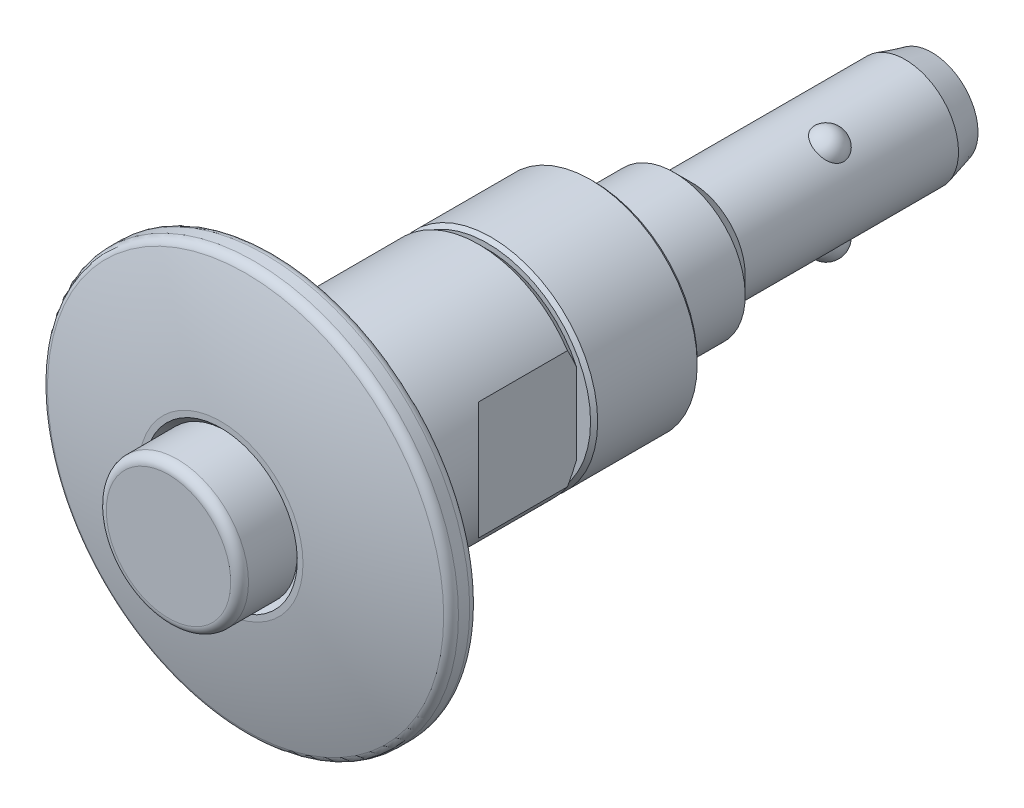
ISO-10303-21;
HEADER;
FILE_DESCRIPTION(('STEP AP214'),'2;1');
FILE_NAME('part.step','',(''),(''),'','','');
FILE_SCHEMA(('AUTOMOTIVE_DESIGN { 1 0 10303 214 1 1 1 1 }'));
ENDSEC;
DATA;
#1=APPLICATION_CONTEXT('core data for automotive mechanical design processes');
#2=APPLICATION_PROTOCOL_DEFINITION('international standard','automotive_design',2000,#1);
#3=PRODUCT_CONTEXT('',#1,'mechanical');
#4=PRODUCT('Part','Part','',(#3));
#5=PRODUCT_RELATED_PRODUCT_CATEGORY('part','',(#4));
#6=PRODUCT_DEFINITION_FORMATION('','',#4);
#7=PRODUCT_DEFINITION_CONTEXT('part definition',#1,'design');
#8=PRODUCT_DEFINITION('design','',#6,#7);
#9=PRODUCT_DEFINITION_SHAPE('','',#8);
#10=(LENGTH_UNIT() NAMED_UNIT(*) SI_UNIT(.MILLI.,.METRE.));
#11=(NAMED_UNIT(*) PLANE_ANGLE_UNIT() SI_UNIT($,.RADIAN.));
#12=(NAMED_UNIT(*) SI_UNIT($,.STERADIAN.) SOLID_ANGLE_UNIT());
#13=UNCERTAINTY_MEASURE_WITH_UNIT(LENGTH_MEASURE(1.E-05),#10,'distance_accuracy_value','');
#14=(GEOMETRIC_REPRESENTATION_CONTEXT(3) GLOBAL_UNCERTAINTY_ASSIGNED_CONTEXT((#13)) GLOBAL_UNIT_ASSIGNED_CONTEXT((#10,
#11,#12)) REPRESENTATION_CONTEXT('',''));
#15=CARTESIAN_POINT('',(0.,0.,0.));
#16=DIRECTION('',(0.,0.,1.));
#17=DIRECTION('',(1.,0.,0.));
#18=AXIS2_PLACEMENT_3D('',#15,#16,#17);
#19=CARTESIAN_POINT('',(1.25745735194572,-2.17798002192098,-11.8));
#20=DIRECTION('',(-0.50000000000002,0.866025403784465,0.));
#21=DIRECTION('',(0.,0.,-1.));
#22=AXIS2_PLACEMENT_3D('',#19,#20,#21);
#23=SPHERICAL_SURFACE('',#22,1.);
#24=CARTESIAN_POINT('',(2.2405663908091,-1.99495920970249,-11.8));
#25=CARTESIAN_POINT('',(2.24056631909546,-1.99495956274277,-11.8461997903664));
#26=CARTESIAN_POINT('',(2.23786747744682,-1.99800289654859,-11.8924030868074));
#27=CARTESIAN_POINT('',(2.22713107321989,-2.00996266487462,-11.983409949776));
#28=CARTESIAN_POINT('',(2.21909208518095,-2.0188806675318,-12.0282131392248));
#29=CARTESIAN_POINT('',(2.19786885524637,-2.04196358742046,-12.1150425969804));
#30=CARTESIAN_POINT('',(2.18469611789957,-2.05611676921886,-12.1570748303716));
#31=CARTESIAN_POINT('',(2.15345971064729,-2.08880832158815,-12.2374414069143));
#32=CARTESIAN_POINT('',(2.13539539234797,-2.10734727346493,-12.2757752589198));
#33=CARTESIAN_POINT('',(2.09404035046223,-2.14845746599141,-12.3491094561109));
#34=CARTESIAN_POINT('',(2.07060081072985,-2.17113880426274,-12.3839637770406));
#35=CARTESIAN_POINT('',(2.01925802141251,-2.21896993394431,-12.4482638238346));
#36=CARTESIAN_POINT('',(1.99135360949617,-2.24412036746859,-12.4777081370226));
#37=CARTESIAN_POINT('',(1.92921474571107,-2.29781233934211,-12.5328114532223));
#38=CARTESIAN_POINT('',(1.89465658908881,-2.32646544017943,-12.5579971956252));
#39=CARTESIAN_POINT('',(1.82157431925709,-2.38412134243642,-12.6011946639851));
#40=CARTESIAN_POINT('',(1.78304902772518,-2.41312424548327,-12.6192042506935));
#41=CARTESIAN_POINT('',(1.7006533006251,-2.47193714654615,-12.648581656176));
#42=CARTESIAN_POINT('',(1.65660658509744,-2.50170619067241,-12.6595384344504));
#43=CARTESIAN_POINT('',(1.56606022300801,-2.55936273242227,-12.6730632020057));
#44=CARTESIAN_POINT('',(1.51956022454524,-2.58724995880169,-12.675629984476));
#45=CARTESIAN_POINT('',(1.42431874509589,-2.6409024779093,-12.6723034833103));
#46=CARTESIAN_POINT('',(1.37555056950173,-2.66660929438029,-12.6662272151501));
#47=CARTESIAN_POINT('',(1.27819603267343,-2.71462002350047,-12.6453652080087));
#48=CARTESIAN_POINT('',(1.22960968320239,-2.7369237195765,-12.630578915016));
#49=CARTESIAN_POINT('',(1.13428398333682,-2.77778449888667,-12.5925339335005));
#50=CARTESIAN_POINT('',(1.08754241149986,-2.79634620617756,-12.5692858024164));
#51=CARTESIAN_POINT('',(0.997563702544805,-2.82969436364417,-12.5146818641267));
#52=CARTESIAN_POINT('',(0.954326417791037,-2.84448097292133,-12.4833263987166));
#53=CARTESIAN_POINT('',(0.874277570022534,-2.87008012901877,-12.4140490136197));
#54=CARTESIAN_POINT('',(0.837323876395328,-2.88098931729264,-12.3763275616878));
#55=CARTESIAN_POINT('',(0.770184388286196,-2.89966092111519,-12.294593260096));
#56=CARTESIAN_POINT('',(0.739995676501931,-2.90742469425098,-12.2505831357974));
#57=CARTESIAN_POINT('',(0.689722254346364,-2.91974521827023,-12.1605282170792));
#58=CARTESIAN_POINT('',(0.669105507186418,-2.92447862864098,-12.1148051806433));
#59=CARTESIAN_POINT('',(0.636345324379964,-2.93178281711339,-12.0202582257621));
#60=CARTESIAN_POINT('',(0.624196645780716,-2.93435493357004,-11.9714362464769));
#61=CARTESIAN_POINT('',(0.609696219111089,-2.93740024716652,-11.8762808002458));
#62=CARTESIAN_POINT('',(0.606642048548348,-2.93802412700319,-11.8300582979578));
#63=CARTESIAN_POINT('',(0.608482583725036,-2.9376436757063,-11.7377843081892));
#64=CARTESIAN_POINT('',(0.613375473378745,-2.93663971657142,-11.6917327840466));
#65=CARTESIAN_POINT('',(0.630538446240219,-2.93300068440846,-11.6027655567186));
#66=CARTESIAN_POINT('',(0.642547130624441,-2.930423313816,-11.559796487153));
#67=CARTESIAN_POINT('',(0.673148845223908,-2.92354492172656,-11.476425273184));
#68=CARTESIAN_POINT('',(0.691742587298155,-2.9192437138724,-11.4360234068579));
#69=CARTESIAN_POINT('',(0.735458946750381,-2.90854284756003,-11.357373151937));
#70=CARTESIAN_POINT('',(0.760784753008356,-2.90207588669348,-11.3192472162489));
#71=CARTESIAN_POINT('',(0.816602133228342,-2.88686621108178,-11.2475035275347));
#72=CARTESIAN_POINT('',(0.847095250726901,-2.87812281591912,-11.2138871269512));
#73=CARTESIAN_POINT('',(0.914597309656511,-2.8574194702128,-11.1494153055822));
#74=CARTESIAN_POINT('',(0.951922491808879,-2.84526835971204,-11.1189523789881));
#75=CARTESIAN_POINT('',(1.02996337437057,-2.81795761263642,-11.0643839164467));
#76=CARTESIAN_POINT('',(1.07068016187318,-2.80279700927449,-11.0402804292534));
#77=CARTESIAN_POINT('',(1.15709228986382,-2.76829255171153,-10.9973428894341));
#78=CARTESIAN_POINT('',(1.20293761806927,-2.74873331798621,-10.978982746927));
#79=CARTESIAN_POINT('',(1.29557162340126,-2.70630578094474,-10.9501623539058));
#80=CARTESIAN_POINT('',(1.3423604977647,-2.68343677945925,-10.9397037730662));
#81=CARTESIAN_POINT('',(1.43722588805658,-2.63388425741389,-10.92658991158));
#82=CARTESIAN_POINT('',(1.48528716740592,-2.60709207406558,-10.9242329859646));
#83=CARTESIAN_POINT('',(1.57959366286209,-2.55105735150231,-10.9281888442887));
#84=CARTESIAN_POINT('',(1.62583870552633,-2.52181457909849,-10.9345024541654));
#85=CARTESIAN_POINT('',(1.71569281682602,-2.46157455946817,-10.9558082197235));
#86=CARTESIAN_POINT('',(1.75927518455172,-2.43056416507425,-10.9708760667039));
#87=CARTESIAN_POINT('',(1.84227905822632,-2.36826975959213,-11.0095322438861));
#88=CARTESIAN_POINT('',(1.88170046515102,-2.33698574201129,-11.0331207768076));
#89=CARTESIAN_POINT('',(1.95498929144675,-2.27601892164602,-11.0880826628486));
#90=CARTESIAN_POINT('',(1.98892124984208,-2.24632076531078,-11.1193526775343));
#91=CARTESIAN_POINT('',(2.05107923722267,-2.18971305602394,-11.1892521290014));
#92=CARTESIAN_POINT('',(2.07930615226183,-2.16280307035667,-11.2278804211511));
#93=CARTESIAN_POINT('',(2.12825022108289,-2.11463443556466,-11.3096673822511));
#94=CARTESIAN_POINT('',(2.14925472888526,-2.09317171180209,-11.3525332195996));
#95=CARTESIAN_POINT('',(2.18501161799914,-2.05582036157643,-11.4430266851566));
#96=CARTESIAN_POINT('',(2.19976977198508,-2.03992659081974,-11.4906498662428));
#97=CARTESIAN_POINT('',(2.22094703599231,-2.01682944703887,-11.5816600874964));
#98=CARTESIAN_POINT('',(2.22829180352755,-2.00867324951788,-11.6245931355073));
#99=CARTESIAN_POINT('',(2.23810081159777,-1.99773873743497,-11.7116832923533));
#100=CARTESIAN_POINT('',(2.2405664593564,-1.9949588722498,-11.7558400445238));
#101=CARTESIAN_POINT('',(2.2405663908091,-1.99495920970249,-11.8));
#102=B_SPLINE_CURVE_WITH_KNOTS('',3,(#24,#25,#26,#27,#28,#29,#30,#31,#32,#33,#34,#35,#36,#37,
#38,#39,#40,#41,#42,#43,#44,#45,#46,#47,#48,#49,#50,#51,#52,#53,#54,#55,#56,#57,#58,#59,#60,#61,
#62,#63,#64,#65,#66,#67,#68,#69,#70,#71,#72,#73,#74,#75,#76,#77,#78,#79,#80,#81,#82,#83,#84,#85,
#86,#87,#88,#89,#90,#91,#92,#93,#94,#95,#96,#97,#98,#99,#100,#101),.UNSPECIFIED.,.T.,.F.,(4,2,2,
2,2,2,2,2,2,2,2,2,2,2,2,2,2,2,2,2,2,2,2,2,2,2,2,2,2,2,2,2,2,2,2,2,2,2,4),(0.,0.138430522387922,
0.276898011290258,0.415056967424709,0.553234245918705,0.69583554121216,0.838474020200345,
0.992219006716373,1.14600979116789,1.30810293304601,1.47021938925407,1.63581958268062,
1.80143031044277,1.96683511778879,2.1322329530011,2.29315873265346,2.45401498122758,
2.60434189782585,2.75457565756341,2.89285916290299,3.03111107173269,3.16457426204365,
3.29805188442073,3.43613636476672,3.57426216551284,3.72268228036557,3.87115015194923,
4.02978554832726,4.18845445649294,4.35290739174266,4.51737599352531,4.68328825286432,
4.84920445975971,5.01300034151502,5.17677076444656,5.33295320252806,5.48899098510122,
5.62134763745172,5.75366611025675),.UNSPECIFIED.);
#103=CARTESIAN_POINT('',(2.2405663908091,-1.99495920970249,-11.8));
#104=VERTEX_POINT('',#103);
#105=EDGE_CURVE('E9',#104,#104,#102,.T.);
#106=ORIENTED_EDGE('',*,*,#105,.F.);
#107=EDGE_LOOP('',(#106));
#108=FACE_BOUND('',#107,.T.);
#109=ADVANCED_FACE('F15',(#108),#23,.T.);
#110=CARTESIAN_POINT('',(0.,0.,23.9464045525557));
#111=DIRECTION('',(0.,0.,-1.));
#112=DIRECTION('',(0.,1.,0.));
#113=AXIS2_PLACEMENT_3D('',#110,#111,#112);
#114=PLANE('',#113);
#115=CARTESIAN_POINT('',(0.,0.,23.9464045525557));
#116=DIRECTION('',(0.,0.,-1.));
#117=DIRECTION('',(0.,1.,0.));
#118=AXIS2_PLACEMENT_3D('',#115,#116,#117);
#119=CIRCLE('',#118,3.5);
#120=CARTESIAN_POINT('',(0.,3.5,23.9464045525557));
#121=VERTEX_POINT('',#120);
#122=EDGE_CURVE('E277',#121,#121,#119,.F.);
#123=ORIENTED_EDGE('',*,*,#122,.T.);
#124=EDGE_LOOP('',(#123));
#125=FACE_BOUND('',#124,.T.);
#126=ADVANCED_FACE('F357',(#125),#114,.F.);
#127=CARTESIAN_POINT('',(0.,0.,23.4464045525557));
#128=DIRECTION('',(0.,0.,-1.));
#129=DIRECTION('',(0.,1.,0.));
#130=AXIS2_PLACEMENT_3D('',#127,#128,#129);
#131=TOROIDAL_SURFACE('',#130,3.5,0.5);
#132=CARTESIAN_POINT('',(0.,0.,23.4464045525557));
#133=DIRECTION('',(0.,0.,-1.));
#134=DIRECTION('',(0.,1.,0.));
#135=AXIS2_PLACEMENT_3D('',#132,#133,#134);
#136=CIRCLE('',#135,4.);
#137=CARTESIAN_POINT('',(0.,4.,23.4464045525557));
#138=VERTEX_POINT('',#137);
#139=EDGE_CURVE('E19',#138,#138,#136,.T.);
#140=ORIENTED_EDGE('',*,*,#139,.F.);
#141=EDGE_LOOP('',(#140));
#142=FACE_BOUND('',#141,.T.);
#143=ORIENTED_EDGE('',*,*,#122,.F.);
#144=EDGE_LOOP('',(#143));
#145=FACE_BOUND('',#144,.T.);
#146=ADVANCED_FACE('F17',(#142,#145),#131,.T.);
#147=CARTESIAN_POINT('',(0.,0.,82.5579051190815));
#148=DIRECTION('',(0.,0.,1.));
#149=DIRECTION('',(0.,-1.,0.));
#150=AXIS2_PLACEMENT_3D('',#147,#148,#149);
#151=CYLINDRICAL_SURFACE('',#150,4.);
#152=CARTESIAN_POINT('',(0.,0.,20.7));
#153=DIRECTION('',(0.,0.,1.));
#154=DIRECTION('',(0.,-1.,0.));
#155=AXIS2_PLACEMENT_3D('',#152,#153,#154);
#156=CIRCLE('',#155,4.);
#157=CARTESIAN_POINT('',(0.,-4.,20.7));
#158=VERTEX_POINT('',#157);
#159=EDGE_CURVE('E259',#158,#158,#156,.T.);
#160=ORIENTED_EDGE('',*,*,#159,.T.);
#161=EDGE_LOOP('',(#160));
#162=FACE_BOUND('',#161,.T.);
#163=ORIENTED_EDGE('',*,*,#139,.T.);
#164=EDGE_LOOP('',(#163));
#165=FACE_BOUND('',#164,.T.);
#166=ADVANCED_FACE('F365',(#162,#165),#151,.T.);
#167=CARTESIAN_POINT('',(0.,0.,20.7));
#168=DIRECTION('',(0.,0.,1.));
#169=DIRECTION('',(0.,-1.,0.));
#170=AXIS2_PLACEMENT_3D('',#167,#168,#169);
#171=CONICAL_SURFACE('',#170,4.,0.785398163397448);
#172=CARTESIAN_POINT('',(0.,0.,21.));
#173=DIRECTION('',(0.,0.,1.));
#174=DIRECTION('',(0.,-1.,0.));
#175=AXIS2_PLACEMENT_3D('',#172,#173,#174);
#176=CIRCLE('',#175,4.3);
#177=CARTESIAN_POINT('',(0.,-4.3,21.));
#178=VERTEX_POINT('',#177);
#179=EDGE_CURVE('E253',#178,#178,#176,.F.);
#180=ORIENTED_EDGE('',*,*,#179,.F.);
#181=EDGE_LOOP('',(#180));
#182=FACE_BOUND('',#181,.T.);
#183=ORIENTED_EDGE('',*,*,#159,.F.);
#184=EDGE_LOOP('',(#183));
#185=FACE_BOUND('',#184,.T.);
#186=ADVANCED_FACE('F399',(#182,#185),#171,.F.);
#187=CARTESIAN_POINT('',(1.75,0.,21.));
#188=DIRECTION('',(0.,0.,1.));
#189=DIRECTION('',(0.,-1.,0.));
#190=AXIS2_PLACEMENT_3D('',#187,#188,#189);
#191=PLANE('',#190);
#192=ORIENTED_EDGE('',*,*,#179,.T.);
#193=EDGE_LOOP('',(#192));
#194=FACE_BOUND('',#193,.T.);
#195=CARTESIAN_POINT('',(0.,0.,21.));
#196=DIRECTION('',(0.,0.,-1.));
#197=DIRECTION('',(0.,1.,0.));
#198=AXIS2_PLACEMENT_3D('',#195,#196,#197);
#199=CIRCLE('',#198,4.62014413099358);
#200=CARTESIAN_POINT('',(4.62014413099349,0.,21.));
#201=VERTEX_POINT('',#200);
#202=EDGE_CURVE('E304',#201,#201,#199,.T.);
#203=ORIENTED_EDGE('',*,*,#202,.F.);
#204=EDGE_LOOP('',(#203));
#205=FACE_BOUND('',#204,.T.);
#206=ADVANCED_FACE('F401',(#194,#205),#191,.T.);
#207=CARTESIAN_POINT('',(0.,0.,-16.7180894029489));
#208=DIRECTION('',(0.,0.,-1.));
#209=DIRECTION('',(1.,0.,0.));
#210=AXIS2_PLACEMENT_3D('',#207,#208,#209);
#211=SPHERICAL_SURFACE('',#210,38.);
#212=CARTESIAN_POINT('',(0.,0.,19.610299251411));
#213=DIRECTION('',(0.,0.,-1.));
#214=DIRECTION('',(0.,1.,0.));
#215=AXIS2_PLACEMENT_3D('',#212,#213,#214);
#216=CIRCLE('',#215,11.1466666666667);
#217=CARTESIAN_POINT('',(11.1466666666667,0.,19.610299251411));
#218=VERTEX_POINT('',#217);
#219=EDGE_CURVE('E418',#218,#218,#216,.F.);
#220=CARTESIAN_POINT('',(11.1466666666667,0.,19.610299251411));
#221=CARTESIAN_POINT('',(11.080129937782,0.,19.6307147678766));
#222=CARTESIAN_POINT('',(11.013537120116,0.,19.6509474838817));
#223=CARTESIAN_POINT('',(10.8802413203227,0.,19.6910467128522));
#224=CARTESIAN_POINT('',(10.8135383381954,0.,19.7109132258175));
#225=CARTESIAN_POINT('',(10.6800242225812,0.,19.7502794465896));
#226=CARTESIAN_POINT('',(10.6132130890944,0.,19.7697791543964));
#227=CARTESIAN_POINT('',(10.4794846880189,0.,19.8084111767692));
#228=CARTESIAN_POINT('',(10.4125674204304,0.,19.8275434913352));
#229=CARTESIAN_POINT('',(10.278628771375,0.,19.8654401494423));
#230=CARTESIAN_POINT('',(10.2116073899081,0.,19.8842044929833));
#231=CARTESIAN_POINT('',(10.0774625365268,0.,19.9213646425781));
#232=CARTESIAN_POINT('',(10.0103390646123,0.,19.9397604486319));
#233=CARTESIAN_POINT('',(9.87599205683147,0.,19.9761829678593));
#234=CARTESIAN_POINT('',(9.80876852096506,0.,19.9942096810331));
#235=CARTESIAN_POINT('',(9.67422341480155,0.,20.0298934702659));
#236=CARTESIAN_POINT('',(9.60690184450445,0.,20.0475505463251));
#237=CARTESIAN_POINT('',(9.47216270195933,0.,20.08249452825));
#238=CARTESIAN_POINT('',(9.4047451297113,0.,20.0997814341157));
#239=CARTESIAN_POINT('',(9.26981601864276,0.,20.1339845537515));
#240=CARTESIAN_POINT('',(9.20230447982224,0.,20.1509007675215));
#241=CARTESIAN_POINT('',(9.06718947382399,0.,20.1843619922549));
#242=CARTESIAN_POINT('',(8.99958600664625,0.,20.2009070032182));
#243=CARTESIAN_POINT('',(8.86428918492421,0.,20.2336253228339));
#244=CARTESIAN_POINT('',(8.79659583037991,0.,20.2497986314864));
#245=CARTESIAN_POINT('',(8.66112127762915,0.,20.2817730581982));
#246=CARTESIAN_POINT('',(8.5933400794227,0.,20.2975741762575));
#247=CARTESIAN_POINT('',(8.45769188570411,0.,20.3288037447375));
#248=CARTESIAN_POINT('',(8.38982489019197,0.,20.3442321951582));
#249=CARTESIAN_POINT('',(8.25400715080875,0.,20.3747159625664));
#250=CARTESIAN_POINT('',(8.18605640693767,0.,20.3897712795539));
#251=CARTESIAN_POINT('',(8.05007322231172,0.,20.4195083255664));
#252=CARTESIAN_POINT('',(7.98204078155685,0.,20.4341900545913));
#253=CARTESIAN_POINT('',(7.84589625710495,0.,20.4631794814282));
#254=CARTESIAN_POINT('',(7.77778417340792,0.,20.4774871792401));
#255=CARTESIAN_POINT('',(7.64148241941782,0.,20.5057281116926));
#256=CARTESIAN_POINT('',(7.57329274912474,0.,20.5196613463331));
#257=CARTESIAN_POINT('',(7.43683788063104,0.,20.54715293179));
#258=CARTESIAN_POINT('',(7.3685726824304,0.,20.5607112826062));
#259=CARTESIAN_POINT('',(7.23196881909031,0.,20.5874526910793));
#260=CARTESIAN_POINT('',(7.16363015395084,0.,20.6006357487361));
#261=CARTESIAN_POINT('',(7.02688141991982,0.,20.6266261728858));
#262=CARTESIAN_POINT('',(6.95847135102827,0.,20.6394335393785));
#263=CARTESIAN_POINT('',(6.82158187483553,0.,20.6646721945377));
#264=CARTESIAN_POINT('',(6.75310246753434,0.,20.677103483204));
#265=CARTESIAN_POINT('',(6.61607638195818,0.,20.701589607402));
#266=CARTESIAN_POINT('',(6.5475297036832,0.,20.7136444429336));
#267=CARTESIAN_POINT('',(6.41037114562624,0.,20.7373772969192));
#268=CARTESIAN_POINT('',(6.34175926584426,0.,20.7490553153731));
#269=CARTESIAN_POINT('',(6.20447237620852,0.,20.7720341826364));
#270=CARTESIAN_POINT('',(6.13579736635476,0.,20.7833350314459));
#271=CARTESIAN_POINT('',(5.99838628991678,0.,20.8055592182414));
#272=CARTESIAN_POINT('',(5.92965022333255,0.,20.8164825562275));
#273=CARTESIAN_POINT('',(5.79211910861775,0.,20.8379513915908));
#274=CARTESIAN_POINT('',(5.72332406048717,0.,20.8484968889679));
#275=CARTESIAN_POINT('',(5.58567705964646,0.,20.8692097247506));
#276=CARTESIAN_POINT('',(5.51682510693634,0.,20.8793770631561));
#277=CARTESIAN_POINT('',(5.37906637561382,0.,20.8993332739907));
#278=CARTESIAN_POINT('',(5.31015959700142,0.,20.9091221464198));
#279=CARTESIAN_POINT('',(5.17229329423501,0.,20.9283211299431));
#280=CARTESIAN_POINT('',(5.10333377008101,0.,20.9377312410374));
#281=CARTESIAN_POINT('',(4.96536405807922,0.,20.9561724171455));
#282=CARTESIAN_POINT('',(4.89635387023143,0.,20.9652034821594));
#283=CARTESIAN_POINT('',(4.75828491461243,0.,20.9828862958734));
#284=CARTESIAN_POINT('',(4.68922614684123,0.,20.9915380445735));
#285=CARTESIAN_POINT('',(4.62014413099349,0.,21.));
#286=B_SPLINE_CURVE_WITH_KNOTS('',3,(#220,#221,#222,#223,#224,#225,#226,#227,#228,#229,#230,
#231,#232,#233,#234,#235,#236,#237,#238,#239,#240,#241,#242,#243,#244,#245,#246,#247,#248,#249,
#250,#251,#252,#253,#254,#255,#256,#257,#258,#259,#260,#261,#262,#263,#264,#265,#266,#267,#268,
#269,#270,#271,#272,#273,#274,#275,#276,#277,#278,#279,#280,#281,#282,#283,#284,#285),
.UNSPECIFIED.,.F.,.F.,(4,2,2,2,2,2,2,2,2,2,2,2,2,2,2,2,2,2,2,2,2,2,2,2,2,2,2,2,2,2,2,2,4),(0.,
0.20879477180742,0.41758954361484,0.626384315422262,0.83517908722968,1.04397385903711,
1.25276863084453,1.46156340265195,1.67035817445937,1.87915294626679,2.08794771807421,
2.29674248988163,2.50553726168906,2.71433203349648,2.9231268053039,3.13192157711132,
3.34071634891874,3.54951112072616,3.75830589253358,3.967100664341,4.17589543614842,
4.38469020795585,4.59348497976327,4.80227975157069,5.01107452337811,5.21986929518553,
5.42866406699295,5.63745883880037,5.8462536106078,6.05504838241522,6.26384315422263,
6.47263792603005,6.68143269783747),.UNSPECIFIED.);
#287=EDGE_CURVE('BSEAM405',#218,#201,#286,.T.);
#288=ORIENTED_EDGE('',*,*,#219,.T.);
#289=ORIENTED_EDGE('',*,*,#202,.T.);
#290=ORIENTED_EDGE('',*,*,#287,.T.);
#291=ORIENTED_EDGE('',*,*,#287,.F.);
#292=EDGE_LOOP('',(#288,#290,#289,#291));
#293=FACE_BOUND('',#292,.T.);
#294=ADVANCED_FACE('F405',(#293),#211,.T.);
#295=CARTESIAN_POINT('',(0.,0.,19.1322941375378));
#296=DIRECTION('',(0.,0.,-1.));
#297=DIRECTION('',(0.,1.,0.));
#298=AXIS2_PLACEMENT_3D('',#295,#296,#297);
#299=TOROIDAL_SURFACE('',#298,11.,0.5);
#300=ORIENTED_EDGE('',*,*,#219,.F.);
#301=EDGE_LOOP('',(#300));
#302=FACE_BOUND('',#301,.T.);
#303=CARTESIAN_POINT('',(0.,0.,19.1322941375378));
#304=DIRECTION('',(0.,0.,-1.));
#305=DIRECTION('',(0.,1.,0.));
#306=AXIS2_PLACEMENT_3D('',#303,#304,#305);
#307=CIRCLE('',#306,11.5);
#308=CARTESIAN_POINT('',(0.,11.5,19.1322941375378));
#309=VERTEX_POINT('',#308);
#310=EDGE_CURVE('E95',#309,#309,#307,.T.);
#311=ORIENTED_EDGE('',*,*,#310,.F.);
#312=EDGE_LOOP('',(#311));
#313=FACE_BOUND('',#312,.T.);
#314=ADVANCED_FACE('F403',(#302,#313),#299,.T.);
#315=CARTESIAN_POINT('',(0.,0.,-5.5));
#316=DIRECTION('',(0.,0.,-1.));
#317=DIRECTION('',(0.,1.,0.));
#318=AXIS2_PLACEMENT_3D('',#315,#316,#317);
#319=CYLINDRICAL_SURFACE('',#318,11.5);
#320=ORIENTED_EDGE('',*,*,#310,.T.);
#321=EDGE_LOOP('',(#320));
#322=FACE_BOUND('',#321,.T.);
#323=CARTESIAN_POINT('',(0.,0.,18.5));
#324=DIRECTION('',(0.,0.,-1.));
#325=DIRECTION('',(0.,1.,0.));
#326=AXIS2_PLACEMENT_3D('',#323,#324,#325);
#327=CIRCLE('',#326,11.5);
#328=CARTESIAN_POINT('',(0.,11.5,18.5));
#329=VERTEX_POINT('',#328);
#330=EDGE_CURVE('E334',#329,#329,#327,.F.);
#331=ORIENTED_EDGE('',*,*,#330,.T.);
#332=EDGE_LOOP('',(#331));
#333=FACE_BOUND('',#332,.T.);
#334=ADVANCED_FACE('F152',(#322,#333),#319,.T.);
#335=CARTESIAN_POINT('',(0.,0.,18.5));
#336=DIRECTION('',(0.,0.,-1.));
#337=DIRECTION('',(0.,1.,0.));
#338=AXIS2_PLACEMENT_3D('',#335,#336,#337);
#339=TOROIDAL_SURFACE('',#338,11.,0.5);
#340=ORIENTED_EDGE('',*,*,#330,.F.);
#341=EDGE_LOOP('',(#340));
#342=FACE_BOUND('',#341,.T.);
#343=CARTESIAN_POINT('',(0.,0.,18.));
#344=DIRECTION('',(0.,0.,-1.));
#345=DIRECTION('',(0.,1.,0.));
#346=AXIS2_PLACEMENT_3D('',#343,#344,#345);
#347=CIRCLE('',#346,11.);
#348=CARTESIAN_POINT('',(0.,11.,18.));
#349=VERTEX_POINT('',#348);
#350=EDGE_CURVE('E331',#349,#349,#347,.T.);
#351=ORIENTED_EDGE('',*,*,#350,.F.);
#352=EDGE_LOOP('',(#351));
#353=FACE_BOUND('',#352,.T.);
#354=ADVANCED_FACE('F147',(#342,#353),#339,.T.);
#355=CARTESIAN_POINT('',(11.5,0.,18.));
#356=DIRECTION('',(0.,0.,-1.));
#357=DIRECTION('',(0.,1.,0.));
#358=AXIS2_PLACEMENT_3D('',#355,#356,#357);
#359=PLANE('',#358);
#360=ORIENTED_EDGE('',*,*,#350,.T.);
#361=EDGE_LOOP('',(#360));
#362=FACE_BOUND('',#361,.T.);
#363=CARTESIAN_POINT('',(0.,0.,18.));
#364=DIRECTION('',(0.,0.,-1.));
#365=DIRECTION('',(0.,1.,0.));
#366=AXIS2_PLACEMENT_3D('',#363,#364,#365);
#367=CIRCLE('',#366,8.);
#368=CARTESIAN_POINT('',(0.,8.,18.));
#369=VERTEX_POINT('',#368);
#370=EDGE_CURVE('E310',#369,#369,#367,.T.);
#371=ORIENTED_EDGE('',*,*,#370,.F.);
#372=EDGE_LOOP('',(#371));
#373=FACE_BOUND('',#372,.T.);
#374=ADVANCED_FACE('F151',(#362,#373),#359,.T.);
#375=CARTESIAN_POINT('',(0.,0.,16.));
#376=DIRECTION('',(0.,0.,-1.));
#377=DIRECTION('',(0.,1.,0.));
#378=AXIS2_PLACEMENT_3D('',#375,#376,#377);
#379=TOROIDAL_SURFACE('',#378,8.,2.);
#380=ORIENTED_EDGE('',*,*,#370,.T.);
#381=EDGE_LOOP('',(#380));
#382=FACE_BOUND('',#381,.T.);
#383=CARTESIAN_POINT('',(0.,0.,16.));
#384=DIRECTION('',(0.,0.,-1.));
#385=DIRECTION('',(0.,1.,0.));
#386=AXIS2_PLACEMENT_3D('',#383,#384,#385);
#387=CIRCLE('',#386,6.);
#388=CARTESIAN_POINT('',(0.,6.,16.));
#389=VERTEX_POINT('',#388);
#390=EDGE_CURVE('E307',#389,#389,#387,.T.);
#391=ORIENTED_EDGE('',*,*,#390,.F.);
#392=EDGE_LOOP('',(#391));
#393=FACE_BOUND('',#392,.T.);
#394=ADVANCED_FACE('F349',(#382,#393),#379,.F.);
#395=CARTESIAN_POINT('',(5.,14.,11.5));
#396=DIRECTION('',(-0.707106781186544,0.,0.707106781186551));
#397=DIRECTION('',(-0.707106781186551,0.,-0.707106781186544));
#398=AXIS2_PLACEMENT_3D('',#395,#396,#397);
#399=PLANE('',#398);
#400=DIRECTION('',(0.,-1.,0.));
#401=VECTOR('',#400,1.);
#402=CARTESIAN_POINT('',(5.,14.,11.5));
#403=LINE('',#402,#401);
#404=CARTESIAN_POINT('',(5.,3.3166247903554,11.5));
#405=VERTEX_POINT('',#404);
#406=CARTESIAN_POINT('',(5.,-3.3166247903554,11.5));
#407=VERTEX_POINT('',#406);
#408=EDGE_CURVE('E296',#405,#407,#403,.T.);
#409=ORIENTED_EDGE('',*,*,#408,.F.);
#410=CARTESIAN_POINT('',(0.,0.,6.5));
#411=DIRECTION('',(-0.707106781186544,0.,0.707106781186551));
#412=DIRECTION('',(-0.707106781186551,0.,-0.707106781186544));
#413=AXIS2_PLACEMENT_3D('',#410,#411,#412);
#414=ELLIPSE('',#413,8.48528137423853,6.);
#415=EDGE_CURVE('E337',#405,#407,#414,.F.);
#416=ORIENTED_EDGE('',*,*,#415,.T.);
#417=EDGE_LOOP('',(#409,#416));
#418=FACE_BOUND('',#417,.T.);
#419=ADVANCED_FACE('F127',(#418),#399,.F.);
#420=CARTESIAN_POINT('',(-5.,14.,11.5));
#421=DIRECTION('',(0.707106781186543,0.,0.707106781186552));
#422=DIRECTION('',(-0.707106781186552,0.,0.707106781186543));
#423=AXIS2_PLACEMENT_3D('',#420,#421,#422);
#424=PLANE('',#423);
#425=DIRECTION('',(0.,-1.,0.));
#426=VECTOR('',#425,1.);
#427=CARTESIAN_POINT('',(-5.,14.,11.5));
#428=LINE('',#427,#426);
#429=CARTESIAN_POINT('',(-5.,3.3166247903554,11.5));
#430=VERTEX_POINT('',#429);
#431=CARTESIAN_POINT('',(-5.,-3.3166247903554,11.5));
#432=VERTEX_POINT('',#431);
#433=EDGE_CURVE('E282',#430,#432,#428,.T.);
#434=ORIENTED_EDGE('',*,*,#433,.T.);
#435=CARTESIAN_POINT('',(0.,0.,6.5));
#436=DIRECTION('',(0.707106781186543,0.,0.707106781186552));
#437=DIRECTION('',(0.707106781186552,0.,-0.707106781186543));
#438=AXIS2_PLACEMENT_3D('',#435,#436,#437);
#439=ELLIPSE('',#438,8.48528137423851,6.);
#440=EDGE_CURVE('E339',#432,#430,#439,.F.);
#441=ORIENTED_EDGE('',*,*,#440,.T.);
#442=EDGE_LOOP('',(#434,#441));
#443=FACE_BOUND('',#442,.T.);
#444=ADVANCED_FACE('F119',(#443),#424,.F.);
#445=CARTESIAN_POINT('',(0.,0.,-5.5));
#446=DIRECTION('',(0.,0.,-1.));
#447=DIRECTION('',(0.,1.,0.));
#448=AXIS2_PLACEMENT_3D('',#445,#446,#447);
#449=CYLINDRICAL_SURFACE('',#448,6.);
#450=DIRECTION('',(0.,0.,-1.));
#451=VECTOR('',#450,1.);
#452=CARTESIAN_POINT('',(5.,3.3166247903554,-5.5));
#453=LINE('',#452,#451);
#454=CARTESIAN_POINT('',(5.,3.3166247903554,6.5));
#455=VERTEX_POINT('',#454);
#456=EDGE_CURVE('E302',#455,#405,#453,.F.);
#457=ORIENTED_EDGE('',*,*,#456,.F.);
#458=CARTESIAN_POINT('',(0.,0.,6.5));
#459=DIRECTION('',(0.,0.,-1.));
#460=DIRECTION('',(0.,1.,0.));
#461=AXIS2_PLACEMENT_3D('',#458,#459,#460);
#462=CIRCLE('',#461,6.);
#463=CARTESIAN_POINT('',(-5.,3.3166247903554,6.5));
#464=VERTEX_POINT('',#463);
#465=EDGE_CURVE('E70',#455,#464,#462,.F.);
#466=ORIENTED_EDGE('',*,*,#465,.T.);
#467=DIRECTION('',(0.,0.,-1.));
#468=VECTOR('',#467,1.);
#469=CARTESIAN_POINT('',(-5.,3.3166247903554,-5.5));
#470=LINE('',#469,#468);
#471=EDGE_CURVE('E286',#430,#464,#470,.T.);
#472=ORIENTED_EDGE('',*,*,#471,.F.);
#473=ORIENTED_EDGE('',*,*,#440,.F.);
#474=DIRECTION('',(0.,0.,-1.));
#475=VECTOR('',#474,1.);
#476=CARTESIAN_POINT('',(-5.,-3.3166247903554,-5.5));
#477=LINE('',#476,#475);
#478=CARTESIAN_POINT('',(-5.,-3.3166247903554,6.5));
#479=VERTEX_POINT('',#478);
#480=EDGE_CURVE('E290',#479,#432,#477,.F.);
#481=ORIENTED_EDGE('',*,*,#480,.F.);
#482=CARTESIAN_POINT('',(0.,0.,6.5));
#483=DIRECTION('',(0.,0.,-1.));
#484=DIRECTION('',(0.,1.,0.));
#485=AXIS2_PLACEMENT_3D('',#482,#483,#484);
#486=CIRCLE('',#485,6.);
#487=CARTESIAN_POINT('',(5.,-3.3166247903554,6.5));
#488=VERTEX_POINT('',#487);
#489=EDGE_CURVE('E93',#479,#488,#486,.F.);
#490=ORIENTED_EDGE('',*,*,#489,.T.);
#491=DIRECTION('',(0.,0.,-1.));
#492=VECTOR('',#491,1.);
#493=CARTESIAN_POINT('',(5.,-3.3166247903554,-5.5));
#494=LINE('',#493,#492);
#495=EDGE_CURVE('E299',#407,#488,#494,.T.);
#496=ORIENTED_EDGE('',*,*,#495,.F.);
#497=ORIENTED_EDGE('',*,*,#415,.F.);
#498=EDGE_LOOP('',(#457,#466,#472,#473,#481,#490,#496,#497));
#499=FACE_BOUND('',#498,.T.);
#500=ORIENTED_EDGE('',*,*,#390,.T.);
#501=EDGE_LOOP('',(#500));
#502=FACE_BOUND('',#501,.T.);
#503=ADVANCED_FACE('F343',(#499,#502),#449,.T.);
#504=CARTESIAN_POINT('',(0.,0.,-17.0535954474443));
#505=DIRECTION('',(0.,0.,1.));
#506=DIRECTION('',(0.,-1.,0.));
#507=AXIS2_PLACEMENT_3D('',#504,#505,#506);
#508=PLANE('',#507);
#509=CARTESIAN_POINT('',(0.,0.,-17.0535954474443));
#510=DIRECTION('',(0.,0.,1.));
#511=DIRECTION('',(0.,-1.,0.));
#512=AXIS2_PLACEMENT_3D('',#509,#510,#511);
#513=CIRCLE('',#512,0.4);
#514=CARTESIAN_POINT('',(0.,-0.400000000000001,-17.0535954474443));
#515=VERTEX_POINT('',#514);
#516=EDGE_CURVE('E263',#515,#515,#513,.T.);
#517=ORIENTED_EDGE('',*,*,#516,.F.);
#518=EDGE_LOOP('',(#517));
#519=FACE_BOUND('',#518,.T.);
#520=ADVANCED_FACE('F395',(#519),#508,.F.);
#521=CARTESIAN_POINT('',(0.,0.,6.));
#522=DIRECTION('',(0.,0.,1.));
#523=DIRECTION('',(0.,-1.,0.));
#524=AXIS2_PLACEMENT_3D('',#521,#522,#523);
#525=CONICAL_SURFACE('',#524,5.5,0.785398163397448);
#526=CARTESIAN_POINT('',(5.,-3.3166247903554,6.5));
#527=CARTESIAN_POINT('',(5.,-3.23335936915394,6.45397809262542));
#528=CARTESIAN_POINT('',(5.,-3.1495829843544,6.40886789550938));
#529=CARTESIAN_POINT('',(5.,-2.98100867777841,6.32075930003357));
#530=CARTESIAN_POINT('',(5.,-2.8962115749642,6.2777593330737));
#531=CARTESIAN_POINT('',(5.,-2.72546167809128,6.19408490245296));
#532=CARTESIAN_POINT('',(5.,-2.63950876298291,6.15341068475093));
#533=CARTESIAN_POINT('',(5.,-2.4663415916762,6.07466608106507));
#534=CARTESIAN_POINT('',(5.,-2.37912643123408,6.03659768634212));
#535=CARTESIAN_POINT('',(5.,-2.2912878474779,6.));
#536=B_SPLINE_CURVE_WITH_KNOTS('',3,(#526,#527,#528,#529,#530,#531,#532,#533,#534,#535),
.UNSPECIFIED.,.F.,.F.,(4,2,2,2,4),(0.,0.285415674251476,0.570615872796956,0.855846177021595,
1.14129206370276),.UNSPECIFIED.);
#537=CARTESIAN_POINT('',(5.,-2.2912878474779,6.));
#538=VERTEX_POINT('',#537);
#539=EDGE_CURVE('E131',#488,#538,#536,.T.);
#540=ORIENTED_EDGE('',*,*,#539,.F.);
#541=ORIENTED_EDGE('',*,*,#489,.F.);
#542=CARTESIAN_POINT('',(-5.,-2.2912878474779,6.));
#543=CARTESIAN_POINT('',(-5.,-2.37912643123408,6.03659768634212));
#544=CARTESIAN_POINT('',(-5.,-2.4663415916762,6.07466608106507));
#545=CARTESIAN_POINT('',(-5.,-2.63950876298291,6.15341068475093));
#546=CARTESIAN_POINT('',(-5.,-2.72546167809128,6.19408490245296));
#547=CARTESIAN_POINT('',(-5.,-2.8962115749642,6.2777593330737));
#548=CARTESIAN_POINT('',(-5.,-2.98100867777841,6.32075930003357));
#549=CARTESIAN_POINT('',(-5.,-3.1495829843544,6.40886789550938));
#550=CARTESIAN_POINT('',(-5.,-3.23335936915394,6.45397809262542));
#551=CARTESIAN_POINT('',(-5.,-3.3166247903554,6.5));
#552=B_SPLINE_CURVE_WITH_KNOTS('',3,(#542,#543,#544,#545,#546,#547,#548,#549,#550,#551),
.UNSPECIFIED.,.F.,.F.,(4,2,2,2,4),(0.,0.285445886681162,0.570676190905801,0.855876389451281,
1.14129206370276),.UNSPECIFIED.);
#553=CARTESIAN_POINT('',(-5.,-2.2912878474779,6.));
#554=VERTEX_POINT('',#553);
#555=EDGE_CURVE('E62',#554,#479,#552,.T.);
#556=ORIENTED_EDGE('',*,*,#555,.F.);
#557=CARTESIAN_POINT('',(0.,0.,6.));
#558=DIRECTION('',(0.,0.,-1.));
#559=DIRECTION('',(0.,1.,0.));
#560=AXIS2_PLACEMENT_3D('',#557,#558,#559);
#561=CIRCLE('',#560,5.5);
#562=EDGE_CURVE('E76',#538,#554,#561,.T.);
#563=ORIENTED_EDGE('',*,*,#562,.F.);
#564=EDGE_LOOP('',(#540,#541,#556,#563));
#565=FACE_BOUND('',#564,.T.);
#566=ADVANCED_FACE('F92',(#565),#525,.T.);
#567=CARTESIAN_POINT('',(5.,14.,11.5));
#568=DIRECTION('',(-1.,0.,0.));
#569=DIRECTION('',(0.,-1.,0.));
#570=AXIS2_PLACEMENT_3D('',#567,#568,#569);
#571=PLANE('',#570);
#572=DIRECTION('',(0.,1.,0.));
#573=VECTOR('',#572,1.);
#574=CARTESIAN_POINT('',(5.,0.,6.));
#575=LINE('',#574,#573);
#576=CARTESIAN_POINT('',(5.,2.2912878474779,6.));
#577=VERTEX_POINT('',#576);
#578=EDGE_CURVE('E74',#538,#577,#575,.T.);
#579=ORIENTED_EDGE('',*,*,#578,.T.);
#580=CARTESIAN_POINT('',(5.,2.2912878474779,6.));
#581=CARTESIAN_POINT('',(5.,2.37912643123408,6.03659768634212));
#582=CARTESIAN_POINT('',(5.,2.4663415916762,6.07466608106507));
#583=CARTESIAN_POINT('',(5.,2.63950876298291,6.15341068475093));
#584=CARTESIAN_POINT('',(5.,2.72546167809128,6.19408490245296));
#585=CARTESIAN_POINT('',(5.,2.8962115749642,6.2777593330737));
#586=CARTESIAN_POINT('',(5.,2.98100867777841,6.32075930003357));
#587=CARTESIAN_POINT('',(5.,3.1495829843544,6.40886789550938));
#588=CARTESIAN_POINT('',(5.,3.23335936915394,6.45397809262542));
#589=CARTESIAN_POINT('',(5.,3.3166247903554,6.5));
#590=B_SPLINE_CURVE_WITH_KNOTS('',3,(#580,#581,#582,#583,#584,#585,#586,#587,#588,#589),
.UNSPECIFIED.,.F.,.F.,(4,2,2,2,4),(0.,0.285445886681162,0.570676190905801,0.855876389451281,
1.14129206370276),.UNSPECIFIED.);
#591=EDGE_CURVE('E138',#577,#455,#590,.T.);
#592=ORIENTED_EDGE('',*,*,#591,.T.);
#593=ORIENTED_EDGE('',*,*,#456,.T.);
#594=ORIENTED_EDGE('',*,*,#408,.T.);
#595=ORIENTED_EDGE('',*,*,#495,.T.);
#596=ORIENTED_EDGE('',*,*,#539,.T.);
#597=EDGE_LOOP('',(#579,#592,#593,#594,#595,#596));
#598=FACE_BOUND('',#597,.T.);
#599=ADVANCED_FACE('F121',(#598),#571,.F.);
#600=CARTESIAN_POINT('',(0.,0.,6.));
#601=DIRECTION('',(0.,0.,1.));
#602=DIRECTION('',(0.,-1.,0.));
#603=AXIS2_PLACEMENT_3D('',#600,#601,#602);
#604=CONICAL_SURFACE('',#603,5.5,0.785398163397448);
#605=CARTESIAN_POINT('',(-5.,3.3166247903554,6.5));
#606=CARTESIAN_POINT('',(-5.,3.23335936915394,6.45397809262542));
#607=CARTESIAN_POINT('',(-5.,3.1495829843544,6.40886789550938));
#608=CARTESIAN_POINT('',(-5.,2.98100867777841,6.32075930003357));
#609=CARTESIAN_POINT('',(-5.,2.8962115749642,6.2777593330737));
#610=CARTESIAN_POINT('',(-5.,2.72546167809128,6.19408490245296));
#611=CARTESIAN_POINT('',(-5.,2.63950876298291,6.15341068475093));
#612=CARTESIAN_POINT('',(-5.,2.4663415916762,6.07466608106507));
#613=CARTESIAN_POINT('',(-5.,2.37912643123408,6.03659768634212));
#614=CARTESIAN_POINT('',(-5.,2.2912878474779,6.));
#615=B_SPLINE_CURVE_WITH_KNOTS('',3,(#605,#606,#607,#608,#609,#610,#611,#612,#613,#614),
.UNSPECIFIED.,.F.,.F.,(4,2,2,2,4),(0.,0.285415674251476,0.570615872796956,0.855846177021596,
1.14129206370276),.UNSPECIFIED.);
#616=CARTESIAN_POINT('',(-5.,2.2912878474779,6.));
#617=VERTEX_POINT('',#616);
#618=EDGE_CURVE('E87',#464,#617,#615,.T.);
#619=ORIENTED_EDGE('',*,*,#618,.F.);
#620=ORIENTED_EDGE('',*,*,#465,.F.);
#621=ORIENTED_EDGE('',*,*,#591,.F.);
#622=CARTESIAN_POINT('',(0.,0.,6.));
#623=DIRECTION('',(0.,0.,-1.));
#624=DIRECTION('',(0.,1.,0.));
#625=AXIS2_PLACEMENT_3D('',#622,#623,#624);
#626=CIRCLE('',#625,5.5);
#627=EDGE_CURVE('E89',#617,#577,#626,.T.);
#628=ORIENTED_EDGE('',*,*,#627,.F.);
#629=EDGE_LOOP('',(#619,#620,#621,#628));
#630=FACE_BOUND('',#629,.T.);
#631=ADVANCED_FACE('F118',(#630),#604,.T.);
#632=CARTESIAN_POINT('',(-5.,14.,11.5));
#633=DIRECTION('',(1.,0.,0.));
#634=DIRECTION('',(0.,1.,0.));
#635=AXIS2_PLACEMENT_3D('',#632,#633,#634);
#636=PLANE('',#635);
#637=ORIENTED_EDGE('',*,*,#471,.T.);
#638=ORIENTED_EDGE('',*,*,#618,.T.);
#639=DIRECTION('',(0.,-1.,0.));
#640=VECTOR('',#639,1.);
#641=CARTESIAN_POINT('',(-5.,0.,6.));
#642=LINE('',#641,#640);
#643=EDGE_CURVE('E34',#617,#554,#642,.T.);
#644=ORIENTED_EDGE('',*,*,#643,.T.);
#645=ORIENTED_EDGE('',*,*,#555,.T.);
#646=ORIENTED_EDGE('',*,*,#480,.T.);
#647=ORIENTED_EDGE('',*,*,#433,.F.);
#648=EDGE_LOOP('',(#637,#638,#644,#645,#646,#647));
#649=FACE_BOUND('',#648,.T.);
#650=ADVANCED_FACE('F85',(#649),#636,.F.);
#651=CARTESIAN_POINT('',(0.,0.,-16.1741725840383));
#652=DIRECTION('',(0.,0.,1.));
#653=DIRECTION('',(-1.,0.,0.));
#654=AXIS2_PLACEMENT_3D('',#651,#652,#653);
#655=CYLINDRICAL_SURFACE('',#654,0.4);
#656=CARTESIAN_POINT('',(0.,0.,-17.2741725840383));
#657=DIRECTION('',(0.,0.,1.));
#658=DIRECTION('',(-1.,0.,0.));
#659=AXIS2_PLACEMENT_3D('',#656,#657,#658);
#660=CIRCLE('',#659,0.4);
#661=CARTESIAN_POINT('',(-0.400000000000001,0.,-17.2741725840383));
#662=VERTEX_POINT('',#661);
#663=EDGE_CURVE('E266',#662,#662,#660,.T.);
#664=ORIENTED_EDGE('',*,*,#663,.F.);
#665=EDGE_LOOP('',(#664));
#666=FACE_BOUND('',#665,.T.);
#667=ORIENTED_EDGE('',*,*,#516,.T.);
#668=EDGE_LOOP('',(#667));
#669=FACE_BOUND('',#668,.T.);
#670=ADVANCED_FACE('F117',(#666,#669),#655,.F.);
#671=CARTESIAN_POINT('',(0.,0.,6.));
#672=DIRECTION('',(0.,0.,1.));
#673=DIRECTION('',(1.,0.,0.));
#674=AXIS2_PLACEMENT_3D('',#671,#672,#673);
#675=PLANE('',#674);
#676=ORIENTED_EDGE('',*,*,#643,.F.);
#677=ORIENTED_EDGE('',*,*,#627,.T.);
#678=ORIENTED_EDGE('',*,*,#578,.F.);
#679=ORIENTED_EDGE('',*,*,#562,.T.);
#680=EDGE_LOOP('',(#676,#677,#678,#679));
#681=FACE_BOUND('',#680,.T.);
#682=CARTESIAN_POINT('',(0.,0.,6.));
#683=DIRECTION('',(0.,0.,1.));
#684=DIRECTION('',(1.,0.,0.));
#685=AXIS2_PLACEMENT_3D('',#682,#683,#684);
#686=CIRCLE('',#685,5.8);
#687=CARTESIAN_POINT('',(5.8,0.,6.));
#688=VERTEX_POINT('',#687);
#689=EDGE_CURVE('E738',#688,#688,#686,.T.);
#690=ORIENTED_EDGE('',*,*,#689,.T.);
#691=EDGE_LOOP('',(#690));
#692=FACE_BOUND('',#691,.T.);
#693=ADVANCED_FACE('F77',(#681,#692),#675,.T.);
#694=CARTESIAN_POINT('',(0.,0.,-18.0535954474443));
#695=DIRECTION('',(0.,0.,-1.));
#696=DIRECTION('',(1.,0.,0.));
#697=AXIS2_PLACEMENT_3D('',#694,#695,#696);
#698=CONICAL_SURFACE('',#697,0.85,0.523598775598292);
#699=ORIENTED_EDGE('',*,*,#663,.T.);
#700=EDGE_LOOP('',(#699));
#701=FACE_BOUND('',#700,.T.);
#702=CARTESIAN_POINT('',(0.,0.,-18.0535954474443));
#703=DIRECTION('',(0.,0.,1.));
#704=DIRECTION('',(-1.,0.,0.));
#705=AXIS2_PLACEMENT_3D('',#702,#703,#704);
#706=CIRCLE('',#705,0.85);
#707=CARTESIAN_POINT('',(-0.850000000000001,0.,-18.0535954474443));
#708=VERTEX_POINT('',#707);
#709=EDGE_CURVE('E269',#708,#708,#706,.T.);
#710=ORIENTED_EDGE('',*,*,#709,.F.);
#711=EDGE_LOOP('',(#710));
#712=FACE_BOUND('',#711,.T.);
#713=ADVANCED_FACE('F204',(#701,#712),#698,.F.);
#714=CARTESIAN_POINT('',(0.,0.,6.));
#715=DIRECTION('',(0.,0.,-1.));
#716=DIRECTION('',(-1.,0.,0.));
#717=AXIS2_PLACEMENT_3D('',#714,#715,#716);
#718=CONICAL_SURFACE('',#717,5.8,0.78539816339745);
#719=CARTESIAN_POINT('',(0.,0.,5.8));
#720=DIRECTION('',(0.,0.,1.));
#721=DIRECTION('',(1.,0.,0.));
#722=AXIS2_PLACEMENT_3D('',#719,#720,#721);
#723=CIRCLE('',#722,6.);
#724=CARTESIAN_POINT('',(6.,0.,5.8));
#725=VERTEX_POINT('',#724);
#726=EDGE_CURVE('E256',#725,#725,#723,.F.);
#727=ORIENTED_EDGE('',*,*,#726,.F.);
#728=EDGE_LOOP('',(#727));
#729=FACE_BOUND('',#728,.T.);
#730=ORIENTED_EDGE('',*,*,#689,.F.);
#731=EDGE_LOOP('',(#730));
#732=FACE_BOUND('',#731,.T.);
#733=ADVANCED_FACE('F221',(#729,#732),#718,.T.);
#734=CARTESIAN_POINT('',(1.65,0.,-18.0535954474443));
#735=DIRECTION('',(0.,0.,1.));
#736=DIRECTION('',(0.,-1.,0.));
#737=AXIS2_PLACEMENT_3D('',#734,#735,#736);
#738=PLANE('',#737);
#739=CARTESIAN_POINT('',(0.,0.,-18.0535954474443));
#740=DIRECTION('',(0.,0.,1.));
#741=DIRECTION('',(0.,-1.,0.));
#742=AXIS2_PLACEMENT_3D('',#739,#740,#741);
#743=CIRCLE('',#742,1.45);
#744=CARTESIAN_POINT('',(0.,-1.45,-18.0535954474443));
#745=VERTEX_POINT('',#744);
#746=EDGE_CURVE('E275',#745,#745,#743,.F.);
#747=ORIENTED_EDGE('',*,*,#746,.T.);
#748=EDGE_LOOP('',(#747));
#749=FACE_BOUND('',#748,.T.);
#750=ORIENTED_EDGE('',*,*,#709,.T.);
#751=EDGE_LOOP('',(#750));
#752=FACE_BOUND('',#751,.T.);
#753=ADVANCED_FACE('F215',(#749,#752),#738,.F.);
#754=CARTESIAN_POINT('',(0.,0.,6.));
#755=DIRECTION('',(0.,0.,-1.));
#756=DIRECTION('',(-1.,0.,0.));
#757=AXIS2_PLACEMENT_3D('',#754,#755,#756);
#758=CYLINDRICAL_SURFACE('',#757,6.);
#759=CARTESIAN_POINT('',(0.,0.,0.199999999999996));
#760=DIRECTION('',(0.,0.,1.));
#761=DIRECTION('',(1.,0.,0.));
#762=AXIS2_PLACEMENT_3D('',#759,#760,#761);
#763=CIRCLE('',#762,6.);
#764=CARTESIAN_POINT('',(6.,0.,0.199999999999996));
#765=VERTEX_POINT('',#764);
#766=EDGE_CURVE('E744',#765,#765,#763,.T.);
#767=ORIENTED_EDGE('',*,*,#766,.T.);
#768=EDGE_LOOP('',(#767));
#769=FACE_BOUND('',#768,.T.);
#770=ORIENTED_EDGE('',*,*,#726,.T.);
#771=EDGE_LOOP('',(#770));
#772=FACE_BOUND('',#771,.T.);
#773=ADVANCED_FACE('F211',(#769,#772),#758,.T.);
#774=CARTESIAN_POINT('',(0.,0.,-17.8535954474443));
#775=DIRECTION('',(0.,0.,1.));
#776=DIRECTION('',(0.,-1.,0.));
#777=AXIS2_PLACEMENT_3D('',#774,#775,#776);
#778=CONICAL_SURFACE('',#777,1.65,0.785398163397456);
#779=ORIENTED_EDGE('',*,*,#746,.F.);
#780=EDGE_LOOP('',(#779));
#781=FACE_BOUND('',#780,.T.);
#782=CARTESIAN_POINT('',(0.,0.,-17.8535954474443));
#783=DIRECTION('',(0.,0.,1.));
#784=DIRECTION('',(0.,-1.,0.));
#785=AXIS2_PLACEMENT_3D('',#782,#783,#784);
#786=CIRCLE('',#785,1.65);
#787=CARTESIAN_POINT('',(0.,-1.65,-17.8535954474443));
#788=VERTEX_POINT('',#787);
#789=EDGE_CURVE('E272',#788,#788,#786,.T.);
#790=ORIENTED_EDGE('',*,*,#789,.F.);
#791=EDGE_LOOP('',(#790));
#792=FACE_BOUND('',#791,.T.);
#793=ADVANCED_FACE('F214',(#781,#792),#778,.T.);
#794=CARTESIAN_POINT('',(0.,0.,0.199999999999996));
#795=DIRECTION('',(0.,0.,1.));
#796=DIRECTION('',(1.,0.,0.));
#797=AXIS2_PLACEMENT_3D('',#794,#795,#796);
#798=CONICAL_SURFACE('',#797,6.,0.785398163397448);
#799=CARTESIAN_POINT('',(0.,0.,0.));
#800=DIRECTION('',(0.,0.,1.));
#801=DIRECTION('',(1.,0.,0.));
#802=AXIS2_PLACEMENT_3D('',#799,#800,#801);
#803=CIRCLE('',#802,5.8);
#804=CARTESIAN_POINT('',(5.8,0.,0.));
#805=VERTEX_POINT('',#804);
#806=EDGE_CURVE('E741',#805,#805,#803,.F.);
#807=ORIENTED_EDGE('',*,*,#806,.F.);
#808=EDGE_LOOP('',(#807));
#809=FACE_BOUND('',#808,.T.);
#810=ORIENTED_EDGE('',*,*,#766,.F.);
#811=EDGE_LOOP('',(#810));
#812=FACE_BOUND('',#811,.T.);
#813=ADVANCED_FACE('F217',(#809,#812),#798,.T.);
#814=CARTESIAN_POINT('',(0.,0.,82.5579051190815));
#815=DIRECTION('',(0.,0.,1.));
#816=DIRECTION('',(0.,-1.,0.));
#817=AXIS2_PLACEMENT_3D('',#814,#815,#816);
#818=CYLINDRICAL_SURFACE('',#817,1.65);
#819=CARTESIAN_POINT('',(0.,0.,-14.2));
#820=DIRECTION('',(0.,0.,-1.));
#821=DIRECTION('',(0.,1.,0.));
#822=AXIS2_PLACEMENT_3D('',#819,#820,#821);
#823=CIRCLE('',#822,1.65);
#824=CARTESIAN_POINT('',(0.,1.65,-14.2));
#825=VERTEX_POINT('',#824);
#826=EDGE_CURVE('E252',#825,#825,#823,.F.);
#827=ORIENTED_EDGE('',*,*,#826,.F.);
#828=EDGE_LOOP('',(#827));
#829=FACE_BOUND('',#828,.T.);
#830=ORIENTED_EDGE('',*,*,#789,.T.);
#831=EDGE_LOOP('',(#830));
#832=FACE_BOUND('',#831,.T.);
#833=ADVANCED_FACE('F209',(#829,#832),#818,.T.);
#834=CARTESIAN_POINT('',(0.,0.,0.));
#835=DIRECTION('',(0.,0.,1.));
#836=DIRECTION('',(1.,0.,0.));
#837=AXIS2_PLACEMENT_3D('',#834,#835,#836);
#838=PLANE('',#837);
#839=CARTESIAN_POINT('',(0.,0.,0.));
#840=DIRECTION('',(0.,0.,1.));
#841=DIRECTION('',(1.,0.,0.));
#842=AXIS2_PLACEMENT_3D('',#839,#840,#841);
#843=CIRCLE('',#842,4.2);
#844=CARTESIAN_POINT('',(4.2,0.,0.));
#845=VERTEX_POINT('',#844);
#846=EDGE_CURVE('E729',#845,#845,#843,.T.);
#847=ORIENTED_EDGE('',*,*,#846,.T.);
#848=EDGE_LOOP('',(#847));
#849=FACE_BOUND('',#848,.T.);
#850=ORIENTED_EDGE('',*,*,#806,.T.);
#851=EDGE_LOOP('',(#850));
#852=FACE_BOUND('',#851,.T.);
#853=ADVANCED_FACE('F205',(#849,#852),#838,.F.);
#854=CARTESIAN_POINT('',(0.,0.,-14.2));
#855=DIRECTION('',(0.,0.,-1.));
#856=DIRECTION('',(0.,1.,0.));
#857=AXIS2_PLACEMENT_3D('',#854,#855,#856);
#858=PLANE('',#857);
#859=CARTESIAN_POINT('',(0.,0.,-14.2));
#860=DIRECTION('',(0.,0.,-1.));
#861=DIRECTION('',(0.,1.,0.));
#862=AXIS2_PLACEMENT_3D('',#859,#860,#861);
#863=CIRCLE('',#862,2.15);
#864=CARTESIAN_POINT('',(0.,2.15,-14.2));
#865=VERTEX_POINT('',#864);
#866=EDGE_CURVE('E314',#865,#865,#863,.T.);
#867=ORIENTED_EDGE('',*,*,#866,.T.);
#868=EDGE_LOOP('',(#867));
#869=FACE_BOUND('',#868,.T.);
#870=ORIENTED_EDGE('',*,*,#826,.T.);
#871=EDGE_LOOP('',(#870));
#872=FACE_BOUND('',#871,.T.);
#873=ADVANCED_FACE('F208',(#869,#872),#858,.T.);
#874=CARTESIAN_POINT('',(0.,0.,0.));
#875=DIRECTION('',(0.,0.,-1.));
#876=DIRECTION('',(-1.,0.,0.));
#877=AXIS2_PLACEMENT_3D('',#874,#875,#876);
#878=CONICAL_SURFACE('',#877,4.2,0.785398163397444);
#879=CARTESIAN_POINT('',(0.,0.,0.2));
#880=DIRECTION('',(0.,0.,1.));
#881=DIRECTION('',(1.,0.,0.));
#882=AXIS2_PLACEMENT_3D('',#879,#880,#881);
#883=CIRCLE('',#882,4.);
#884=CARTESIAN_POINT('',(4.,0.,0.2));
#885=VERTEX_POINT('',#884);
#886=EDGE_CURVE('E735',#885,#885,#883,.F.);
#887=ORIENTED_EDGE('',*,*,#886,.F.);
#888=EDGE_LOOP('',(#887));
#889=FACE_BOUND('',#888,.T.);
#890=ORIENTED_EDGE('',*,*,#846,.F.);
#891=EDGE_LOOP('',(#890));
#892=FACE_BOUND('',#891,.T.);
#893=ADVANCED_FACE('F231',(#889,#892),#878,.F.);
#894=CARTESIAN_POINT('',(0.,0.,-14.2));
#895=DIRECTION('',(0.,0.,-1.));
#896=DIRECTION('',(0.,1.,0.));
#897=AXIS2_PLACEMENT_3D('',#894,#895,#896);
#898=CYLINDRICAL_SURFACE('',#897,2.15);
#899=ORIENTED_EDGE('',*,*,#866,.F.);
#900=EDGE_LOOP('',(#899));
#901=FACE_BOUND('',#900,.T.);
#902=CARTESIAN_POINT('',(0.,0.,-19.));
#903=DIRECTION('',(0.,0.,-1.));
#904=DIRECTION('',(0.,1.,0.));
#905=AXIS2_PLACEMENT_3D('',#902,#903,#904);
#906=CIRCLE('',#905,2.15);
#907=CARTESIAN_POINT('',(0.,2.15,-19.));
#908=VERTEX_POINT('',#907);
#909=EDGE_CURVE('E313',#908,#908,#906,.T.);
#910=ORIENTED_EDGE('',*,*,#909,.T.);
#911=EDGE_LOOP('',(#910));
#912=FACE_BOUND('',#911,.T.);
#913=ADVANCED_FACE('F168',(#901,#912),#898,.F.);
#914=CARTESIAN_POINT('',(0.,0.,64.6224672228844));
#915=DIRECTION('',(0.,0.,1.));
#916=DIRECTION('',(0.,-1.,0.));
#917=AXIS2_PLACEMENT_3D('',#914,#915,#916);
#918=CYLINDRICAL_SURFACE('',#917,4.);
#919=ORIENTED_EDGE('',*,*,#886,.T.);
#920=EDGE_LOOP('',(#919));
#921=FACE_BOUND('',#920,.T.);
#922=CARTESIAN_POINT('',(0.,0.,-4.5));
#923=DIRECTION('',(0.,0.,1.));
#924=DIRECTION('',(0.,-1.,0.));
#925=AXIS2_PLACEMENT_3D('',#922,#923,#924);
#926=CIRCLE('',#925,4.);
#927=CARTESIAN_POINT('',(0.,-4.,-4.5));
#928=VERTEX_POINT('',#927);
#929=EDGE_CURVE('E322',#928,#928,#926,.T.);
#930=ORIENTED_EDGE('',*,*,#929,.T.);
#931=EDGE_LOOP('',(#930));
#932=FACE_BOUND('',#931,.T.);
#933=ADVANCED_FACE('F164',(#921,#932),#918,.T.);
#934=CARTESIAN_POINT('',(3.,0.,-19.));
#935=DIRECTION('',(0.,0.,1.));
#936=DIRECTION('',(0.,-1.,0.));
#937=AXIS2_PLACEMENT_3D('',#934,#935,#936);
#938=PLANE('',#937);
#939=ORIENTED_EDGE('',*,*,#909,.F.);
#940=EDGE_LOOP('',(#939));
#941=FACE_BOUND('',#940,.T.);
#942=CARTESIAN_POINT('',(0.,0.,-19.));
#943=DIRECTION('',(0.,0.,1.));
#944=DIRECTION('',(0.,-1.,0.));
#945=AXIS2_PLACEMENT_3D('',#942,#943,#944);
#946=CIRCLE('',#945,2.59807621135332);
#947=CARTESIAN_POINT('',(0.,-2.59807621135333,-19.));
#948=VERTEX_POINT('',#947);
#949=EDGE_CURVE('E328',#948,#948,#946,.F.);
#950=ORIENTED_EDGE('',*,*,#949,.T.);
#951=EDGE_LOOP('',(#950));
#952=FACE_BOUND('',#951,.T.);
#953=ADVANCED_FACE('F167',(#941,#952),#938,.F.);
#954=CARTESIAN_POINT('',(1.25745735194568,2.17798002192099,-11.8));
#955=DIRECTION('',(-0.500000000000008,-0.866025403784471,0.));
#956=DIRECTION('',(0.,0.,-1.));
#957=AXIS2_PLACEMENT_3D('',#954,#955,#956);
#958=SPHERICAL_SURFACE('',#957,1.);
#959=CARTESIAN_POINT('',(2.24056639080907,1.99495920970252,-11.8));
#960=CARTESIAN_POINT('',(2.24056631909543,1.9949595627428,-11.7538002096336));
#961=CARTESIAN_POINT('',(2.23786747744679,1.99800289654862,-11.7075969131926));
#962=CARTESIAN_POINT('',(2.22713107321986,2.00996266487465,-11.616590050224));
#963=CARTESIAN_POINT('',(2.21909208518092,2.01888066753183,-11.5717868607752));
#964=CARTESIAN_POINT('',(2.19786885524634,2.04196358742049,-11.4849574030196));
#965=CARTESIAN_POINT('',(2.18469611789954,2.05611676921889,-11.4429251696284));
#966=CARTESIAN_POINT('',(2.15345971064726,2.08880832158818,-11.3625585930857));
#967=CARTESIAN_POINT('',(2.13539539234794,2.10734727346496,-11.3242247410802));
#968=CARTESIAN_POINT('',(2.0940403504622,2.14845746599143,-11.2508905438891));
#969=CARTESIAN_POINT('',(2.07060081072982,2.17113880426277,-11.2160362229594));
#970=CARTESIAN_POINT('',(2.01925802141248,2.21896993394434,-11.1517361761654));
#971=CARTESIAN_POINT('',(1.99135360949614,2.24412036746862,-11.1222918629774));
#972=CARTESIAN_POINT('',(1.92921474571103,2.29781233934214,-11.0671885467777));
#973=CARTESIAN_POINT('',(1.89465658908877,2.32646544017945,-11.0420028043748));
#974=CARTESIAN_POINT('',(1.82157431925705,2.38412134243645,-10.9988053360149));
#975=CARTESIAN_POINT('',(1.78304902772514,2.41312424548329,-10.9807957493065));
#976=CARTESIAN_POINT('',(1.70065330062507,2.47193714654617,-10.951418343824));
#977=CARTESIAN_POINT('',(1.6566065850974,2.50170619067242,-10.9404615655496));
#978=CARTESIAN_POINT('',(1.56606022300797,2.55936273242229,-10.9269367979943));
#979=CARTESIAN_POINT('',(1.51956022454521,2.58724995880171,-10.924370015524));
#980=CARTESIAN_POINT('',(1.42431874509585,2.64090247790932,-10.9276965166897));
#981=CARTESIAN_POINT('',(1.37555056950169,2.66660929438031,-10.93377278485));
#982=CARTESIAN_POINT('',(1.27819603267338,2.71462002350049,-10.9546347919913));
#983=CARTESIAN_POINT('',(1.22960968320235,2.73692371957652,-10.969421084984));
#984=CARTESIAN_POINT('',(1.13428398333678,2.77778449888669,-11.0074660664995));
#985=CARTESIAN_POINT('',(1.08754241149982,2.79634620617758,-11.0307141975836));
#986=CARTESIAN_POINT('',(0.99756370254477,2.82969436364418,-11.0853181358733));
#987=CARTESIAN_POINT('',(0.954326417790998,2.84448097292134,-11.1166736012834));
#988=CARTESIAN_POINT('',(0.874277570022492,2.87008012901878,-11.1859509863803));
#989=CARTESIAN_POINT('',(0.837323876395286,2.88098931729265,-11.2236724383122));
#990=CARTESIAN_POINT('',(0.770184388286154,2.8996609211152,-11.3054067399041));
#991=CARTESIAN_POINT('',(0.739995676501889,2.90742469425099,-11.3494168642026));
#992=CARTESIAN_POINT('',(0.689722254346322,2.91974521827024,-11.4394717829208));
#993=CARTESIAN_POINT('',(0.669105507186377,2.92447862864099,-11.4851948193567));
#994=CARTESIAN_POINT('',(0.636345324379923,2.9317828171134,-11.5797417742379));
#995=CARTESIAN_POINT('',(0.624196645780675,2.93435493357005,-11.6285637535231));
#996=CARTESIAN_POINT('',(0.609696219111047,2.93740024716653,-11.7237191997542));
#997=CARTESIAN_POINT('',(0.606642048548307,2.9380241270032,-11.7699417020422));
#998=CARTESIAN_POINT('',(0.608482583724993,2.93764367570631,-11.8622156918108));
#999=CARTESIAN_POINT('',(0.613375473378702,2.93663971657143,-11.9082672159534));
#1000=CARTESIAN_POINT('',(0.630538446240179,2.93300068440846,-11.9972344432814));
#1001=CARTESIAN_POINT('',(0.642547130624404,2.93042331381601,-12.040203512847));
#1002=CARTESIAN_POINT('',(0.673148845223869,2.92354492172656,-12.1235747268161));
#1003=CARTESIAN_POINT('',(0.69174258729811,2.91924371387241,-12.1639765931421));
#1004=CARTESIAN_POINT('',(0.735458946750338,2.90854284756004,-12.242626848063));
#1005=CARTESIAN_POINT('',(0.760784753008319,2.90207588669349,-12.2807527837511));
#1006=CARTESIAN_POINT('',(0.816602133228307,2.88686621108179,-12.3524964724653));
#1007=CARTESIAN_POINT('',(0.847095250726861,2.87812281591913,-12.3861128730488));
#1008=CARTESIAN_POINT('',(0.914597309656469,2.85741947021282,-12.4505846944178));
#1009=CARTESIAN_POINT('',(0.951922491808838,2.84526835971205,-12.4810476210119));
#1010=CARTESIAN_POINT('',(1.02996337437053,2.81795761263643,-12.5356160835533));
#1011=CARTESIAN_POINT('',(1.07068016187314,2.8027970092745,-12.5597195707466));
#1012=CARTESIAN_POINT('',(1.15709228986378,2.76829255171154,-12.6026571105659));
#1013=CARTESIAN_POINT('',(1.20293761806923,2.74873331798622,-12.621017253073));
#1014=CARTESIAN_POINT('',(1.29557162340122,2.70630578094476,-12.6498376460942));
#1015=CARTESIAN_POINT('',(1.34236049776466,2.68343677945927,-12.6602962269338));
#1016=CARTESIAN_POINT('',(1.43722588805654,2.63388425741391,-12.67341008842));
#1017=CARTESIAN_POINT('',(1.48528716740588,2.6070920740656,-12.6757670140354));
#1018=CARTESIAN_POINT('',(1.57959366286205,2.55105735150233,-12.6718111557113));
#1019=CARTESIAN_POINT('',(1.62583870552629,2.5218145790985,-12.6654975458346));
#1020=CARTESIAN_POINT('',(1.71569281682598,2.46157455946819,-12.6441917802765));
#1021=CARTESIAN_POINT('',(1.75927518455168,2.43056416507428,-12.6291239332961));
#1022=CARTESIAN_POINT('',(1.84227905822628,2.36826975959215,-12.5904677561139));
#1023=CARTESIAN_POINT('',(1.88170046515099,2.33698574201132,-12.5668792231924));
#1024=CARTESIAN_POINT('',(1.95498929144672,2.27601892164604,-12.5119173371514));
#1025=CARTESIAN_POINT('',(1.98892124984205,2.2463207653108,-12.4806473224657));
#1026=CARTESIAN_POINT('',(2.05107923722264,2.18971305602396,-12.4107478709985));
#1027=CARTESIAN_POINT('',(2.0793061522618,2.1628030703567,-12.3721195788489));
#1028=CARTESIAN_POINT('',(2.12825022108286,2.11463443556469,-12.2903326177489));
#1029=CARTESIAN_POINT('',(2.14925472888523,2.09317171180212,-12.2474667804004));
#1030=CARTESIAN_POINT('',(2.18501161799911,2.05582036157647,-12.1569733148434));
#1031=CARTESIAN_POINT('',(2.19976977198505,2.03992659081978,-12.1093501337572));
#1032=CARTESIAN_POINT('',(2.22094703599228,2.0168294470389,-12.0183399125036));
#1033=CARTESIAN_POINT('',(2.22829180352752,2.00867324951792,-11.9754068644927));
#1034=CARTESIAN_POINT('',(2.23810081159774,1.997738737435,-11.8883167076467));
#1035=CARTESIAN_POINT('',(2.24056645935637,1.99495887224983,-11.8441599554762));
#1036=CARTESIAN_POINT('',(2.24056639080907,1.99495920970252,-11.8));
#1037=B_SPLINE_CURVE_WITH_KNOTS('',3,(#959,#960,#961,#962,#963,#964,#965,#966,#967,#968,#969,
#970,#971,#972,#973,#974,#975,#976,#977,#978,#979,#980,#981,#982,#983,#984,#985,#986,#987,#988,
#989,#990,#991,#992,#993,#994,#995,#996,#997,#998,#999,#1000,#1001,#1002,#1003,#1004,#1005,
#1006,#1007,#1008,#1009,#1010,#1011,#1012,#1013,#1014,#1015,#1016,#1017,#1018,#1019,#1020,#1021,
#1022,#1023,#1024,#1025,#1026,#1027,#1028,#1029,#1030,#1031,#1032,#1033,#1034,#1035,#1036),
.UNSPECIFIED.,.T.,.F.,(4,2,2,2,2,2,2,2,2,2,2,2,2,2,2,2,2,2,2,2,2,2,2,2,2,2,2,2,2,2,2,2,2,2,2,2,
2,2,4),(0.,0.138430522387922,0.276898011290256,0.415056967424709,0.553234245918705,
0.695835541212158,0.838474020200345,0.992219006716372,1.14600979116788,1.308102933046,
1.47021938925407,1.63581958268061,1.80143031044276,1.96683511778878,2.1322329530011,
2.29315873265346,2.45401498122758,2.60434189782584,2.75457565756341,2.89285916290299,
3.03111107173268,3.16457426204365,3.29805188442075,3.43613636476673,3.57426216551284,
3.72268228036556,3.87115015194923,4.02978554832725,4.18845445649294,4.35290739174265,
4.5173759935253,4.68328825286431,4.84920445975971,5.01300034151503,5.17677076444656,
5.33295320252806,5.48899098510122,5.62134763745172,5.75366611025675),.UNSPECIFIED.);
#1038=CARTESIAN_POINT('',(2.24056639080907,1.99495920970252,-11.8));
#1039=VERTEX_POINT('',#1038);
#1040=EDGE_CURVE('E88',#1039,#1039,#1037,.T.);
#1041=ORIENTED_EDGE('',*,*,#1040,.F.);
#1042=EDGE_LOOP('',(#1041));
#1043=FACE_BOUND('',#1042,.T.);
#1044=ADVANCED_FACE('F162',(#1043),#958,.T.);
#1045=CARTESIAN_POINT('',(0.,0.,-4.5));
#1046=DIRECTION('',(0.,0.,1.));
#1047=DIRECTION('',(0.,-1.,0.));
#1048=AXIS2_PLACEMENT_3D('',#1045,#1046,#1047);
#1049=CONICAL_SURFACE('',#1048,4.,0.785398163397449);
#1050=CARTESIAN_POINT('',(0.,0.,-5.5));
#1051=DIRECTION('',(0.,0.,1.));
#1052=DIRECTION('',(0.,-1.,0.));
#1053=AXIS2_PLACEMENT_3D('',#1050,#1051,#1052);
#1054=CIRCLE('',#1053,3.);
#1055=CARTESIAN_POINT('',(0.,-3.,-5.5));
#1056=VERTEX_POINT('',#1055);
#1057=EDGE_CURVE('E317',#1056,#1056,#1054,.T.);
#1058=ORIENTED_EDGE('',*,*,#1057,.T.);
#1059=EDGE_LOOP('',(#1058));
#1060=FACE_BOUND('',#1059,.T.);
#1061=ORIENTED_EDGE('',*,*,#929,.F.);
#1062=EDGE_LOOP('',(#1061));
#1063=FACE_BOUND('',#1062,.T.);
#1064=ADVANCED_FACE('F158',(#1060,#1063),#1049,.T.);
#1065=CARTESIAN_POINT('',(0.,0.,-17.5));
#1066=DIRECTION('',(0.,0.,1.));
#1067=DIRECTION('',(0.,-1.,0.));
#1068=AXIS2_PLACEMENT_3D('',#1065,#1066,#1067);
#1069=CONICAL_SURFACE('',#1068,3.,0.261799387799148);
#1070=ORIENTED_EDGE('',*,*,#949,.F.);
#1071=EDGE_LOOP('',(#1070));
#1072=FACE_BOUND('',#1071,.T.);
#1073=CARTESIAN_POINT('',(0.,0.,-17.5));
#1074=DIRECTION('',(0.,0.,1.));
#1075=DIRECTION('',(0.,-1.,0.));
#1076=AXIS2_PLACEMENT_3D('',#1073,#1074,#1075);
#1077=CIRCLE('',#1076,3.);
#1078=CARTESIAN_POINT('',(0.,-3.,-17.5));
#1079=VERTEX_POINT('',#1078);
#1080=EDGE_CURVE('E325',#1079,#1079,#1077,.T.);
#1081=ORIENTED_EDGE('',*,*,#1080,.F.);
#1082=EDGE_LOOP('',(#1081));
#1083=FACE_BOUND('',#1082,.T.);
#1084=ADVANCED_FACE('F154',(#1072,#1083),#1069,.T.);
#1085=CARTESIAN_POINT('',(-2.51491470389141,0.,-11.8));
#1086=DIRECTION('',(1.00000000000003,0.,0.));
#1087=DIRECTION('',(0.,0.,-1.));
#1088=AXIS2_PLACEMENT_3D('',#1085,#1086,#1087);
#1089=SPHERICAL_SURFACE('',#1088,1.);
#1090=CARTESIAN_POINT('',(-2.84796855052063,-0.942907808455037,-11.8));
#1091=CARTESIAN_POINT('',(-2.84796882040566,-0.942907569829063,-11.8461997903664));
#1092=CARTESIAN_POINT('',(-2.84925500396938,-0.939048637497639,-11.8924030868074));
#1093=CARTESIAN_POINT('',(-2.85424426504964,-0.923770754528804,-11.983409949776));
#1094=CARTESIAN_POINT('',(-2.8579479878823,-0.912349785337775,-12.0282131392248));
#1095=CARTESIAN_POINT('',(-2.86732676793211,-0.882428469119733,-12.1150425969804));
#1096=CARTESIAN_POINT('',(-2.87299741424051,-0.863943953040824,-12.1570748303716));
#1097=CARTESIAN_POINT('',(-2.88569092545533,-0.820546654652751,-12.2374414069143));
#1098=CARTESIAN_POINT('',(-2.89271396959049,-0.795633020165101,-12.2757752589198));
#1099=CARTESIAN_POINT('',(-2.90763891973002,-0.739263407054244,-12.3491094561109));
#1100=CARTESIAN_POINT('',(-2.91556176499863,-0.707623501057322,-12.3839637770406));
#1101=CARTESIAN_POINT('',(-2.93131334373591,-0.63924377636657,-12.4482638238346));
#1102=CARTESIAN_POINT('',(-2.93914205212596,-0.60250263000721,-12.4777081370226));
#1103=CARTESIAN_POINT('',(-2.95457123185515,-0.521842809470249,-12.5328114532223));
#1104=CARTESIAN_POINT('',(-2.96210646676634,-0.477588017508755,-12.5579971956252));
#1105=CARTESIAN_POINT('',(-2.97549680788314,-0.385468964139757,-12.6011946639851));
#1106=CARTESIAN_POINT('',(-2.98135141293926,-0.337603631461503,-12.6192042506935));
#1107=CARTESIAN_POINT('',(-2.99108701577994,-0.236840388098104,-12.648581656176));
#1108=CARTESIAN_POINT('',(-2.99484440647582,-0.183810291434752,-12.6595384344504));
#1109=CARTESIAN_POINT('',(-2.99950325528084,-0.0765665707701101,-12.6730632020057));
#1110=CARTESIAN_POINT('',(-3.00040430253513,-0.0223527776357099,-12.675629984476));
#1111=CARTESIAN_POINT('',(-2.99924800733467,0.0869550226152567,-12.6723034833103));
#1112=CARTESIAN_POINT('',(-2.99712667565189,0.142042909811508,-12.6662272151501));
#1113=CARTESIAN_POINT('',(-2.99002791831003,0.250359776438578,-12.6453652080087));
#1114=CARTESIAN_POINT('',(-2.98505031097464,0.30358863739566,-12.630578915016));
#1115=CARTESIAN_POINT('',(-2.97277393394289,0.406573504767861,-12.5925339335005));
#1116=CARTESIAN_POINT('',(-2.96547805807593,0.45633374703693,-12.5692858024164));
#1117=CARTESIAN_POINT('',(-2.94936905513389,0.550931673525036,-12.5146818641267));
#1118=CARTESIAN_POINT('',(-2.94055599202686,0.595769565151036,-12.4833263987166));
#1119=CARTESIAN_POINT('',(-2.92270108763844,0.677893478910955,-12.4140490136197));
#1120=CARTESIAN_POINT('',(-2.91367187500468,0.715350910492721,-12.3763275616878));
#1121=CARTESIAN_POINT('',(-2.89627221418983,0.782831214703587,-12.2945932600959));
#1122=CARTESIAN_POINT('',(-2.88790148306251,0.812857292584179,-12.2505831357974));
#1123=CARTESIAN_POINT('',(-2.87343465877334,0.862555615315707,-12.1605282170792));
#1124=CARTESIAN_POINT('',(-2.86722553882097,0.882776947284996,-12.1148051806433));
#1125=CARTESIAN_POINT('',(-2.85717106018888,0.914800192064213,-12.0202582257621));
#1126=CARTESIAN_POINT('',(-2.85332423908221,0.926607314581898,-11.9714362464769));
#1127=CARTESIAN_POINT('',(-2.84871134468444,0.94068770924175,-11.8762808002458));
#1128=CARTESIAN_POINT('',(-2.84772455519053,0.943644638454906,-11.8300582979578));
#1129=CARTESIAN_POINT('',(-2.84831534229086,0.941860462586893,-11.7377843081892));
#1130=CARTESIAN_POINT('',(-2.84989233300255,0.937121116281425,-11.6917327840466));
#1131=CARTESIAN_POINT('',(-2.85532232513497,0.920438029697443,-11.6027655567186));
#1132=CARTESIAN_POINT('',(-2.85909459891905,0.908749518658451,-11.559796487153));
#1133=CARTESIAN_POINT('',(-2.86843859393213,0.878808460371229,-11.476425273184));
#1134=CARTESIAN_POINT('',(-2.8740105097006,0.860555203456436,-11.4360234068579));
#1135=CARTESIAN_POINT('',(-2.8866014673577,0.817345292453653,-11.357373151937));
#1136=CARTESIAN_POINT('',(-2.89366381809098,0.792179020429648,-11.3192472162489));
#1137=CARTESIAN_POINT('',(-2.90840054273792,0.736234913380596,-11.2475035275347));
#1138=CARTESIAN_POINT('',(-2.91607509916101,0.705455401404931,-11.2138871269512));
#1139=CARTESIAN_POINT('',(-2.93189650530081,0.636645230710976,-11.1494153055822));
#1140=CARTESIAN_POINT('',(-2.94003592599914,0.598245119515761,-11.1189523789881));
#1141=CARTESIAN_POINT('',(-2.95540456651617,0.517004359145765,-11.0643839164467));
#1142=CARTESIAN_POINT('',(-2.96263349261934,0.474162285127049,-11.0402804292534));
#1143=CARTESIAN_POINT('',(-2.97595781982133,0.3820749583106,-10.9973428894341));
#1144=CARTESIAN_POINT('',(-2.98194169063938,0.33259212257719,-10.978982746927));
#1145=CARTESIAN_POINT('',(-2.99151536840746,0.23115495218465,-10.9501623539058));
#1146=CARTESIAN_POINT('',(-2.99510466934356,0.179200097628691,-10.9397037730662));
#1147=CARTESIAN_POINT('',(-2.99962362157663,0.0722679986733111,-10.92658991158));
#1148=CARTESIAN_POINT('',(-3.00045154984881,0.017249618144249,-10.9242329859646));
#1149=CARTESIAN_POINT('',(-2.99907730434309,-0.0924395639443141,-10.9281888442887));
#1150=CARTESIAN_POINT('',(-2.99687484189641,-0.147110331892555,-10.9345024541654));
#1151=CARTESIAN_POINT('',(-2.98963251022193,-0.255046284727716,-10.9558082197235));
#1152=CARTESIAN_POINT('',(-2.98456790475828,-0.308294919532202,-10.9708760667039));
#1153=CARTESIAN_POINT('',(-2.97212130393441,-0.411325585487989,-11.0095322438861));
#1154=CARTESIAN_POINT('',(-2.96473925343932,-0.46110753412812,-11.0331207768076));
#1155=CARTESIAN_POINT('',(-2.94858485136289,-0.555060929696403,-11.0880826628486));
#1156=CARTESIAN_POINT('',(-2.93983147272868,-0.59929594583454,-11.1193526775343));
#1157=CARTESIAN_POINT('',(-2.92188675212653,-0.681430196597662,-11.1892521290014));
#1158=CARTESIAN_POINT('',(-2.91269547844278,-0.71933041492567,-11.2278804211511));
#1159=CARTESIAN_POINT('',(-2.89545225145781,-0.785801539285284,-11.3096673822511));
#1160=CARTESIAN_POINT('',(-2.8873672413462,-0.814723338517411,-11.3525332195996));
#1161=CARTESIAN_POINT('',(-2.87289846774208,-0.864365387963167,-11.4430266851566));
#1162=CARTESIAN_POINT('',(-2.86651313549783,-0.885093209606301,-11.4906498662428));
#1163=CARTESIAN_POINT('',(-2.85709905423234,-0.914981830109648,-11.5816600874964));
#1164=CARTESIAN_POINT('',(-2.85370796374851,-0.92542068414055,-11.6245931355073));
#1165=CARTESIAN_POINT('',(-2.84914290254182,-0.93938279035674,-11.7116832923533));
#1166=CARTESIAN_POINT('',(-2.84796829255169,-0.942908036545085,-11.7558400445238));
#1167=CARTESIAN_POINT('',(-2.84796855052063,-0.942907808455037,-11.8));
#1168=B_SPLINE_CURVE_WITH_KNOTS('',3,(#1090,#1091,#1092,#1093,#1094,#1095,#1096,#1097,#1098,
#1099,#1100,#1101,#1102,#1103,#1104,#1105,#1106,#1107,#1108,#1109,#1110,#1111,#1112,#1113,#1114,
#1115,#1116,#1117,#1118,#1119,#1120,#1121,#1122,#1123,#1124,#1125,#1126,#1127,#1128,#1129,#1130,
#1131,#1132,#1133,#1134,#1135,#1136,#1137,#1138,#1139,#1140,#1141,#1142,#1143,#1144,#1145,#1146,
#1147,#1148,#1149,#1150,#1151,#1152,#1153,#1154,#1155,#1156,#1157,#1158,#1159,#1160,#1161,#1162,
#1163,#1164,#1165,#1166,#1167),.UNSPECIFIED.,.T.,.F.,(4,2,2,2,2,2,2,2,2,2,2,2,2,2,2,2,2,2,2,2,2,
2,2,2,2,2,2,2,2,2,2,2,2,2,2,2,2,2,4),(0.,0.138430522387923,0.276898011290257,0.41505696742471,
0.553234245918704,0.695835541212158,0.838474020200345,0.992219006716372,1.14600979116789,
1.30810293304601,1.47021938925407,1.63581958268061,1.80143031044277,1.96683511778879,
2.1322329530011,2.29315873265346,2.45401498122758,2.60434189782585,2.75457565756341,
2.89285916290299,3.03111107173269,3.16457426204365,3.29805188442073,3.43613636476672,
3.57426216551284,3.72268228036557,3.87115015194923,4.02978554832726,4.18845445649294,
4.35290739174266,4.51737599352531,4.68328825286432,4.84920445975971,5.01300034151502,
5.17677076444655,5.33295320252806,5.48899098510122,5.62134763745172,5.75366611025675),.UNSPECIFIED.);
#1169=CARTESIAN_POINT('',(-2.84796855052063,-0.942907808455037,-11.8));
#1170=VERTEX_POINT('',#1169);
#1171=EDGE_CURVE('E25',#1170,#1170,#1168,.T.);
#1172=ORIENTED_EDGE('',*,*,#1171,.F.);
#1173=EDGE_LOOP('',(#1172));
#1174=FACE_BOUND('',#1173,.T.);
#1175=ADVANCED_FACE('F157',(#1174),#1089,.T.);
#1176=CARTESIAN_POINT('',(0.,0.,64.6224672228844));
#1177=DIRECTION('',(0.,0.,1.));
#1178=DIRECTION('',(0.,-1.,0.));
#1179=AXIS2_PLACEMENT_3D('',#1176,#1177,#1178);
#1180=CYLINDRICAL_SURFACE('',#1179,3.);
#1181=ORIENTED_EDGE('',*,*,#1171,.T.);
#1182=EDGE_LOOP('',(#1181));
#1183=FACE_BOUND('',#1182,.T.);
#1184=ORIENTED_EDGE('',*,*,#1080,.T.);
#1185=EDGE_LOOP('',(#1184));
#1186=FACE_BOUND('',#1185,.T.);
#1187=ORIENTED_EDGE('',*,*,#1057,.F.);
#1188=EDGE_LOOP('',(#1187));
#1189=FACE_BOUND('',#1188,.T.);
#1190=ORIENTED_EDGE('',*,*,#1040,.T.);
#1191=EDGE_LOOP('',(#1190));
#1192=FACE_BOUND('',#1191,.T.);
#1193=ORIENTED_EDGE('',*,*,#105,.T.);
#1194=EDGE_LOOP('',(#1193));
#1195=FACE_BOUND('',#1194,.T.);
#1196=ADVANCED_FACE('F170',(#1183,#1186,#1189,#1192,#1195),#1180,.T.);
#1197=CLOSED_SHELL('',(#109,#126,#146,#166,#186,#206,#294,#314,#334,#354,#374,#394,#419,#444,
#503,#520,#566,#599,#631,#650,#670,#693,#713,#733,#753,#773,#793,#813,#833,#853,#873,#893,#913,
#933,#953,#1044,#1064,#1084,#1175,#1196));
#1198=CARTESIAN_POINT('',(0.,0.,5.8));
#1199=DIRECTION('',(0.,0.,1.));
#1200=DIRECTION('',(1.,0.,0.));
#1201=AXIS2_PLACEMENT_3D('',#1198,#1199,#1200);
#1202=CONICAL_SURFACE('',#1201,4.,0.785398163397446);
#1203=CARTESIAN_POINT('',(0.,0.,5.81));
#1204=DIRECTION('',(0.,0.,1.));
#1205=DIRECTION('',(0.,-1.,0.));
#1206=AXIS2_PLACEMENT_3D('',#1203,#1204,#1205);
#1207=CIRCLE('',#1206,4.01);
#1208=CARTESIAN_POINT('',(0.,-4.01,5.81));
#1209=VERTEX_POINT('',#1208);
#1210=EDGE_CURVE('E82',#1209,#1209,#1207,.T.);
#1211=ORIENTED_EDGE('',*,*,#1210,.F.);
#1212=EDGE_LOOP('',(#1211));
#1213=FACE_BOUND('',#1212,.T.);
#1214=CARTESIAN_POINT('',(0.,0.,6.));
#1215=DIRECTION('',(0.,0.,1.));
#1216=DIRECTION('',(1.,0.,0.));
#1217=AXIS2_PLACEMENT_3D('',#1214,#1215,#1216);
#1218=CIRCLE('',#1217,4.2);
#1219=CARTESIAN_POINT('',(4.2,0.,6.));
#1220=VERTEX_POINT('',#1219);
#1221=EDGE_CURVE('E732',#1220,#1220,#1218,.F.);
#1222=ORIENTED_EDGE('',*,*,#1221,.F.);
#1223=EDGE_LOOP('',(#1222));
#1224=FACE_BOUND('',#1223,.T.);
#1225=ADVANCED_FACE('F225',(#1213,#1224),#1202,.F.);
#1226=CARTESIAN_POINT('',(6.,0.,6.));
#1227=DIRECTION('',(0.,0.,-1.));
#1228=DIRECTION('',(0.,1.,0.));
#1229=AXIS2_PLACEMENT_3D('',#1226,#1227,#1228);
#1230=PLANE('',#1229);
#1231=ORIENTED_EDGE('',*,*,#1221,.T.);
#1232=EDGE_LOOP('',(#1231));
#1233=FACE_BOUND('',#1232,.T.);
#1234=CARTESIAN_POINT('',(0.,0.,6.));
#1235=DIRECTION('',(0.,0.,-1.));
#1236=DIRECTION('',(0.,1.,0.));
#1237=AXIS2_PLACEMENT_3D('',#1234,#1235,#1236);
#1238=CIRCLE('',#1237,4.01);
#1239=CARTESIAN_POINT('',(0.,4.01,6.));
#1240=VERTEX_POINT('',#1239);
#1241=EDGE_CURVE('E250',#1240,#1240,#1238,.T.);
#1242=ORIENTED_EDGE('',*,*,#1241,.F.);
#1243=EDGE_LOOP('',(#1242));
#1244=FACE_BOUND('',#1243,.T.);
#1245=ADVANCED_FACE('F228',(#1233,#1244),#1230,.T.);
#1246=CARTESIAN_POINT('',(0.,0.,-5.5));
#1247=DIRECTION('',(0.,0.,-1.));
#1248=DIRECTION('',(0.,1.,0.));
#1249=AXIS2_PLACEMENT_3D('',#1246,#1247,#1248);
#1250=CYLINDRICAL_SURFACE('',#1249,4.01);
#1251=ORIENTED_EDGE('',*,*,#1210,.T.);
#1252=EDGE_LOOP('',(#1251));
#1253=FACE_BOUND('',#1252,.T.);
#1254=ORIENTED_EDGE('',*,*,#1241,.T.);
#1255=EDGE_LOOP('',(#1254));
#1256=FACE_BOUND('',#1255,.T.);
#1257=ADVANCED_FACE('F234',(#1253,#1256),#1250,.T.);
#1258=CLOSED_SHELL('',(#1225,#1245,#1257));
#1259=ORIENTED_CLOSED_SHELL('',*,#1258,.T.);
#1260=BREP_WITH_VOIDS('B1',#1197,(#1259));
#1261=ADVANCED_BREP_SHAPE_REPRESENTATION('',(#18,#1260),#14);
#1262=SHAPE_DEFINITION_REPRESENTATION(#9,#1261);
ENDSEC;
END-ISO-10303-21;
